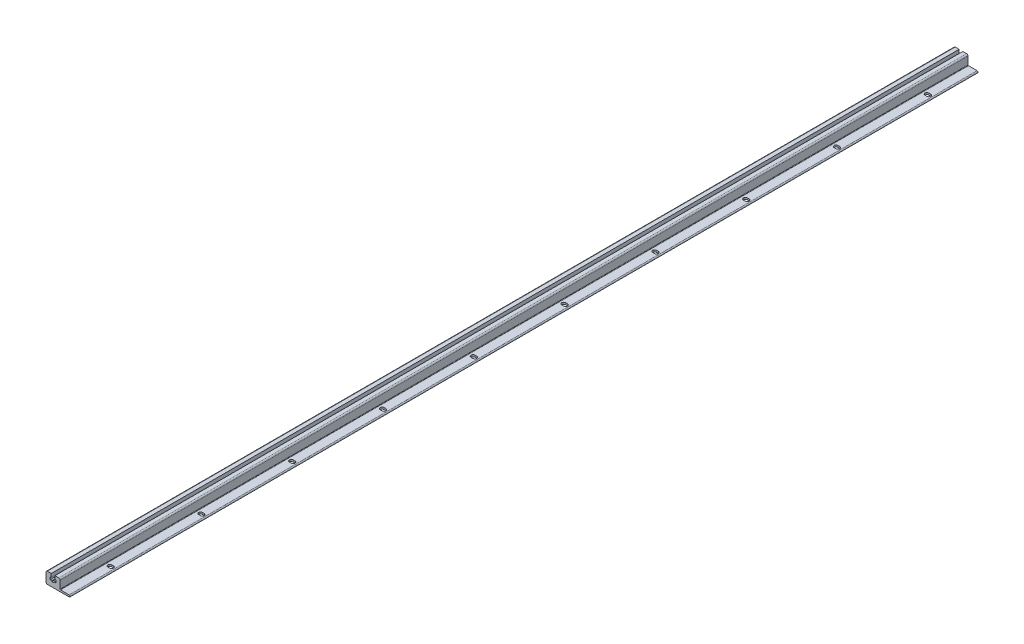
ISO-10303-21;
HEADER;
FILE_DESCRIPTION(('STEP AP214'),'2;1');
FILE_NAME('part.step','',(''),(''),'','','');
FILE_SCHEMA(('AUTOMOTIVE_DESIGN { 1 0 10303 214 1 1 1 1 }'));
ENDSEC;
DATA;
#1=APPLICATION_CONTEXT('core data for automotive mechanical design processes');
#2=APPLICATION_PROTOCOL_DEFINITION('international standard','automotive_design',2000,#1);
#3=PRODUCT_CONTEXT('',#1,'mechanical');
#4=PRODUCT('Part','Part','',(#3));
#5=PRODUCT_RELATED_PRODUCT_CATEGORY('part','',(#4));
#6=PRODUCT_DEFINITION_FORMATION('','',#4);
#7=PRODUCT_DEFINITION_CONTEXT('part definition',#1,'design');
#8=PRODUCT_DEFINITION('design','',#6,#7);
#9=PRODUCT_DEFINITION_SHAPE('','',#8);
#10=(LENGTH_UNIT() NAMED_UNIT(*) SI_UNIT(.MILLI.,.METRE.));
#11=(NAMED_UNIT(*) PLANE_ANGLE_UNIT() SI_UNIT($,.RADIAN.));
#12=(NAMED_UNIT(*) SI_UNIT($,.STERADIAN.) SOLID_ANGLE_UNIT());
#13=UNCERTAINTY_MEASURE_WITH_UNIT(LENGTH_MEASURE(1.E-05),#10,'distance_accuracy_value','');
#14=(GEOMETRIC_REPRESENTATION_CONTEXT(3) GLOBAL_UNCERTAINTY_ASSIGNED_CONTEXT((#13)) GLOBAL_UNIT_ASSIGNED_CONTEXT((#10,
#11,#12)) REPRESENTATION_CONTEXT('',''));
#15=CARTESIAN_POINT('',(0.,0.,0.));
#16=DIRECTION('',(0.,0.,1.));
#17=DIRECTION('',(1.,0.,0.));
#18=AXIS2_PLACEMENT_3D('',#15,#16,#17);
#19=CARTESIAN_POINT('',(-6.20000381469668,12.2000000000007,0.));
#20=DIRECTION('',(0.,1.,0.));
#21=DIRECTION('',(0.,0.,1.));
#22=AXIS2_PLACEMENT_3D('',#19,#20,#21);
#23=PLANE('',#22);
#24=DIRECTION('',(0.,0.,1.));
#25=VECTOR('',#24,1.);
#26=CARTESIAN_POINT('',(-2.55,12.2000000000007,0.));
#27=LINE('',#26,#25);
#28=CARTESIAN_POINT('',(-2.55,12.2000000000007,0.));
#29=VERTEX_POINT('',#28);
#30=CARTESIAN_POINT('',(-2.55,12.2000000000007,2000.));
#31=VERTEX_POINT('',#30);
#32=EDGE_CURVE('E432',#29,#31,#27,.T.);
#33=ORIENTED_EDGE('',*,*,#32,.F.);
#34=DIRECTION('',(-1.,0.,0.));
#35=VECTOR('',#34,1.);
#36=CARTESIAN_POINT('',(-6.20000381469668,12.2000000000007,0.));
#37=LINE('',#36,#35);
#38=CARTESIAN_POINT('',(-6.20000381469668,12.2000000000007,0.));
#39=VERTEX_POINT('',#38);
#40=EDGE_CURVE('E423',#29,#39,#37,.T.);
#41=ORIENTED_EDGE('',*,*,#40,.T.);
#42=DIRECTION('',(0.,0.,1.));
#43=VECTOR('',#42,1.);
#44=CARTESIAN_POINT('',(-6.20000381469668,12.2000000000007,0.));
#45=LINE('',#44,#43);
#46=CARTESIAN_POINT('',(-6.20000381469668,12.2000000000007,2000.));
#47=VERTEX_POINT('',#46);
#48=EDGE_CURVE('E878',#39,#47,#45,.T.);
#49=ORIENTED_EDGE('',*,*,#48,.T.);
#50=DIRECTION('',(-1.,0.,0.));
#51=VECTOR('',#50,1.);
#52=CARTESIAN_POINT('',(-6.20000381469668,12.2000000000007,2000.));
#53=LINE('',#52,#51);
#54=EDGE_CURVE('E783',#31,#47,#53,.T.);
#55=ORIENTED_EDGE('',*,*,#54,.F.);
#56=EDGE_LOOP('',(#33,#41,#49,#55));
#57=FACE_BOUND('',#56,.T.);
#58=ADVANCED_FACE('F14',(#57),#23,.T.);
#59=CARTESIAN_POINT('',(35.5,2.,0.));
#60=DIRECTION('',(0.,0.,1.));
#61=DIRECTION('',(1.,0.,0.));
#62=AXIS2_PLACEMENT_3D('',#59,#60,#61);
#63=CYLINDRICAL_SURFACE('',#62,2.);
#64=CARTESIAN_POINT('',(35.5,2.,2000.));
#65=DIRECTION('',(0.,0.,1.));
#66=DIRECTION('',(1.,0.,0.));
#67=AXIS2_PLACEMENT_3D('',#64,#65,#66);
#68=CIRCLE('',#67,2.);
#69=CARTESIAN_POINT('',(35.5,0.,2000.));
#70=VERTEX_POINT('',#69);
#71=CARTESIAN_POINT('',(35.4999999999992,4.,2000.));
#72=VERTEX_POINT('',#71);
#73=EDGE_CURVE('E750',#70,#72,#68,.T.);
#74=ORIENTED_EDGE('',*,*,#73,.F.);
#75=DIRECTION('',(0.,0.,1.));
#76=VECTOR('',#75,1.);
#77=CARTESIAN_POINT('',(35.5,0.,0.));
#78=LINE('',#77,#76);
#79=CARTESIAN_POINT('',(35.5,0.,0.));
#80=VERTEX_POINT('',#79);
#81=EDGE_CURVE('E9',#80,#70,#78,.T.);
#82=ORIENTED_EDGE('',*,*,#81,.F.);
#83=CARTESIAN_POINT('',(35.5,2.,0.));
#84=DIRECTION('',(0.,0.,1.));
#85=DIRECTION('',(1.,0.,0.));
#86=AXIS2_PLACEMENT_3D('',#83,#84,#85);
#87=CIRCLE('',#86,2.);
#88=CARTESIAN_POINT('',(35.4999999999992,4.,0.));
#89=VERTEX_POINT('',#88);
#90=EDGE_CURVE('E811',#80,#89,#87,.T.);
#91=ORIENTED_EDGE('',*,*,#90,.T.);
#92=DIRECTION('',(0.,0.,1.));
#93=VECTOR('',#92,1.);
#94=CARTESIAN_POINT('',(35.4999999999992,4.,0.));
#95=LINE('',#94,#93);
#96=EDGE_CURVE('E18',#89,#72,#95,.T.);
#97=ORIENTED_EDGE('',*,*,#96,.T.);
#98=EDGE_LOOP('',(#74,#82,#91,#97));
#99=FACE_BOUND('',#98,.T.);
#100=ADVANCED_FACE('F16',(#99),#63,.T.);
#101=CARTESIAN_POINT('',(-12.5,0.,0.));
#102=DIRECTION('',(0.,-1.,0.));
#103=DIRECTION('',(0.,0.,-1.));
#104=AXIS2_PLACEMENT_3D('',#101,#102,#103);
#105=PLANE('',#104);
#106=CARTESIAN_POINT('',(24.9999999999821,0.,100.));
#107=DIRECTION('',(0.,1.,0.));
#108=DIRECTION('',(0.,0.,1.));
#109=AXIS2_PLACEMENT_3D('',#106,#107,#108);
#110=CIRCLE('',#109,4.25);
#111=CARTESIAN_POINT('',(24.9999999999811,0.,95.75));
#112=VERTEX_POINT('',#111);
#113=CARTESIAN_POINT('',(24.9999999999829,0.,104.25));
#114=VERTEX_POINT('',#113);
#115=EDGE_CURVE('E449',#112,#114,#110,.T.);
#116=ORIENTED_EDGE('',*,*,#115,.T.);
#117=DIRECTION('',(1.,0.,0.));
#118=VECTOR('',#117,1.);
#119=CARTESIAN_POINT('',(28.9999999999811,0.,104.25));
#120=LINE('',#119,#118);
#121=CARTESIAN_POINT('',(28.9999999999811,0.,104.25));
#122=VERTEX_POINT('',#121);
#123=EDGE_CURVE('E452',#114,#122,#120,.T.);
#124=ORIENTED_EDGE('',*,*,#123,.T.);
#125=CARTESIAN_POINT('',(28.9999999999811,0.,100.));
#126=DIRECTION('',(0.,1.,0.));
#127=DIRECTION('',(0.,0.,1.));
#128=AXIS2_PLACEMENT_3D('',#125,#126,#127);
#129=CIRCLE('',#128,4.25);
#130=CARTESIAN_POINT('',(28.9999999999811,0.,95.75));
#131=VERTEX_POINT('',#130);
#132=EDGE_CURVE('E39',#122,#131,#129,.T.);
#133=ORIENTED_EDGE('',*,*,#132,.T.);
#134=DIRECTION('',(-1.,0.,0.));
#135=VECTOR('',#134,1.);
#136=CARTESIAN_POINT('',(28.9999999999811,0.,95.75));
#137=LINE('',#136,#135);
#138=EDGE_CURVE('E456',#131,#112,#137,.T.);
#139=ORIENTED_EDGE('',*,*,#138,.T.);
#140=EDGE_LOOP('',(#116,#124,#133,#139));
#141=FACE_BOUND('',#140,.T.);
#142=CARTESIAN_POINT('',(24.9999999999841,0.,300.));
#143=DIRECTION('',(0.,1.,0.));
#144=DIRECTION('',(0.,0.,1.));
#145=AXIS2_PLACEMENT_3D('',#142,#143,#144);
#146=CIRCLE('',#145,4.25);
#147=CARTESIAN_POINT('',(24.9999999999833,0.,295.75));
#148=VERTEX_POINT('',#147);
#149=CARTESIAN_POINT('',(24.999999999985,0.,304.25));
#150=VERTEX_POINT('',#149);
#151=EDGE_CURVE('E479',#148,#150,#146,.T.);
#152=ORIENTED_EDGE('',*,*,#151,.T.);
#153=DIRECTION('',(1.,0.,0.));
#154=VECTOR('',#153,1.);
#155=CARTESIAN_POINT('',(28.9999999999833,0.,304.25));
#156=LINE('',#155,#154);
#157=CARTESIAN_POINT('',(28.9999999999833,0.,304.25));
#158=VERTEX_POINT('',#157);
#159=EDGE_CURVE('E482',#150,#158,#156,.T.);
#160=ORIENTED_EDGE('',*,*,#159,.T.);
#161=CARTESIAN_POINT('',(28.9999999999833,0.,300.));
#162=DIRECTION('',(0.,1.,0.));
#163=DIRECTION('',(0.,0.,1.));
#164=AXIS2_PLACEMENT_3D('',#161,#162,#163);
#165=CIRCLE('',#164,4.25);
#166=CARTESIAN_POINT('',(28.9999999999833,0.,295.75));
#167=VERTEX_POINT('',#166);
#168=EDGE_CURVE('E485',#158,#167,#165,.T.);
#169=ORIENTED_EDGE('',*,*,#168,.T.);
#170=DIRECTION('',(-1.,0.,0.));
#171=VECTOR('',#170,1.);
#172=CARTESIAN_POINT('',(28.9999999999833,0.,295.75));
#173=LINE('',#172,#171);
#174=EDGE_CURVE('E488',#167,#148,#173,.T.);
#175=ORIENTED_EDGE('',*,*,#174,.T.);
#176=EDGE_LOOP('',(#152,#160,#169,#175));
#177=FACE_BOUND('',#176,.T.);
#178=CARTESIAN_POINT('',(24.9999999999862,0.,500.));
#179=DIRECTION('',(0.,1.,0.));
#180=DIRECTION('',(0.,0.,1.));
#181=AXIS2_PLACEMENT_3D('',#178,#179,#180);
#182=CIRCLE('',#181,4.25);
#183=CARTESIAN_POINT('',(24.9999999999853,0.,495.75));
#184=VERTEX_POINT('',#183);
#185=CARTESIAN_POINT('',(24.9999999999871,0.,504.25));
#186=VERTEX_POINT('',#185);
#187=EDGE_CURVE('E511',#184,#186,#182,.T.);
#188=ORIENTED_EDGE('',*,*,#187,.T.);
#189=DIRECTION('',(1.,0.,0.));
#190=VECTOR('',#189,1.);
#191=CARTESIAN_POINT('',(28.9999999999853,0.,504.25));
#192=LINE('',#191,#190);
#193=CARTESIAN_POINT('',(28.9999999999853,0.,504.25));
#194=VERTEX_POINT('',#193);
#195=EDGE_CURVE('E514',#186,#194,#192,.T.);
#196=ORIENTED_EDGE('',*,*,#195,.T.);
#197=CARTESIAN_POINT('',(28.9999999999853,0.,500.));
#198=DIRECTION('',(0.,1.,0.));
#199=DIRECTION('',(0.,0.,1.));
#200=AXIS2_PLACEMENT_3D('',#197,#198,#199);
#201=CIRCLE('',#200,4.25);
#202=CARTESIAN_POINT('',(28.9999999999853,0.,495.75));
#203=VERTEX_POINT('',#202);
#204=EDGE_CURVE('E517',#194,#203,#201,.T.);
#205=ORIENTED_EDGE('',*,*,#204,.T.);
#206=DIRECTION('',(-1.,0.,0.));
#207=VECTOR('',#206,1.);
#208=CARTESIAN_POINT('',(28.9999999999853,0.,495.75));
#209=LINE('',#208,#207);
#210=EDGE_CURVE('E520',#203,#184,#209,.T.);
#211=ORIENTED_EDGE('',*,*,#210,.T.);
#212=EDGE_LOOP('',(#188,#196,#205,#211));
#213=FACE_BOUND('',#212,.T.);
#214=CARTESIAN_POINT('',(24.9999999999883,0.,700.));
#215=DIRECTION('',(0.,1.,0.));
#216=DIRECTION('',(0.,0.,1.));
#217=AXIS2_PLACEMENT_3D('',#214,#215,#216);
#218=CIRCLE('',#217,4.25);
#219=CARTESIAN_POINT('',(24.9999999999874,0.,695.75));
#220=VERTEX_POINT('',#219);
#221=CARTESIAN_POINT('',(24.9999999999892,0.,704.25));
#222=VERTEX_POINT('',#221);
#223=EDGE_CURVE('E543',#220,#222,#218,.T.);
#224=ORIENTED_EDGE('',*,*,#223,.T.);
#225=DIRECTION('',(1.,0.,0.));
#226=VECTOR('',#225,1.);
#227=CARTESIAN_POINT('',(28.9999999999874,0.,704.25));
#228=LINE('',#227,#226);
#229=CARTESIAN_POINT('',(28.9999999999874,0.,704.25));
#230=VERTEX_POINT('',#229);
#231=EDGE_CURVE('E546',#222,#230,#228,.T.);
#232=ORIENTED_EDGE('',*,*,#231,.T.);
#233=CARTESIAN_POINT('',(28.9999999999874,0.,700.));
#234=DIRECTION('',(0.,1.,0.));
#235=DIRECTION('',(0.,0.,1.));
#236=AXIS2_PLACEMENT_3D('',#233,#234,#235);
#237=CIRCLE('',#236,4.25);
#238=CARTESIAN_POINT('',(28.9999999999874,0.,695.75));
#239=VERTEX_POINT('',#238);
#240=EDGE_CURVE('E549',#230,#239,#237,.T.);
#241=ORIENTED_EDGE('',*,*,#240,.T.);
#242=DIRECTION('',(-1.,0.,0.));
#243=VECTOR('',#242,1.);
#244=CARTESIAN_POINT('',(28.9999999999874,0.,695.75));
#245=LINE('',#244,#243);
#246=EDGE_CURVE('E552',#239,#220,#245,.T.);
#247=ORIENTED_EDGE('',*,*,#246,.T.);
#248=EDGE_LOOP('',(#224,#232,#241,#247));
#249=FACE_BOUND('',#248,.T.);
#250=CARTESIAN_POINT('',(24.9999999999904,0.,900.));
#251=DIRECTION('',(0.,1.,0.));
#252=DIRECTION('',(0.,0.,1.));
#253=AXIS2_PLACEMENT_3D('',#250,#251,#252);
#254=CIRCLE('',#253,4.25);
#255=CARTESIAN_POINT('',(24.9999999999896,0.,895.75));
#256=VERTEX_POINT('',#255);
#257=CARTESIAN_POINT('',(24.9999999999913,0.,904.25));
#258=VERTEX_POINT('',#257);
#259=EDGE_CURVE('E575',#256,#258,#254,.T.);
#260=ORIENTED_EDGE('',*,*,#259,.T.);
#261=DIRECTION('',(1.,0.,0.));
#262=VECTOR('',#261,1.);
#263=CARTESIAN_POINT('',(28.9999999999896,0.,904.25));
#264=LINE('',#263,#262);
#265=CARTESIAN_POINT('',(28.9999999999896,0.,904.25));
#266=VERTEX_POINT('',#265);
#267=EDGE_CURVE('E578',#258,#266,#264,.T.);
#268=ORIENTED_EDGE('',*,*,#267,.T.);
#269=CARTESIAN_POINT('',(28.9999999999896,0.,900.));
#270=DIRECTION('',(0.,1.,0.));
#271=DIRECTION('',(0.,0.,1.));
#272=AXIS2_PLACEMENT_3D('',#269,#270,#271);
#273=CIRCLE('',#272,4.25);
#274=CARTESIAN_POINT('',(28.9999999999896,0.,895.75));
#275=VERTEX_POINT('',#274);
#276=EDGE_CURVE('E581',#266,#275,#273,.T.);
#277=ORIENTED_EDGE('',*,*,#276,.T.);
#278=DIRECTION('',(-1.,0.,0.));
#279=VECTOR('',#278,1.);
#280=CARTESIAN_POINT('',(28.9999999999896,0.,895.75));
#281=LINE('',#280,#279);
#282=EDGE_CURVE('E584',#275,#256,#281,.T.);
#283=ORIENTED_EDGE('',*,*,#282,.T.);
#284=EDGE_LOOP('',(#260,#268,#277,#283));
#285=FACE_BOUND('',#284,.T.);
#286=CARTESIAN_POINT('',(24.9999999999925,0.,1100.));
#287=DIRECTION('',(0.,1.,0.));
#288=DIRECTION('',(0.,0.,1.));
#289=AXIS2_PLACEMENT_3D('',#286,#287,#288);
#290=CIRCLE('',#289,4.25);
#291=CARTESIAN_POINT('',(24.9999999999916,0.,1095.75));
#292=VERTEX_POINT('',#291);
#293=CARTESIAN_POINT('',(24.9999999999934,0.,1104.25));
#294=VERTEX_POINT('',#293);
#295=EDGE_CURVE('E607',#292,#294,#290,.T.);
#296=ORIENTED_EDGE('',*,*,#295,.T.);
#297=DIRECTION('',(1.,0.,0.));
#298=VECTOR('',#297,1.);
#299=CARTESIAN_POINT('',(28.9999999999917,0.,1104.25));
#300=LINE('',#299,#298);
#301=CARTESIAN_POINT('',(28.9999999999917,0.,1104.25));
#302=VERTEX_POINT('',#301);
#303=EDGE_CURVE('E610',#294,#302,#300,.T.);
#304=ORIENTED_EDGE('',*,*,#303,.T.);
#305=CARTESIAN_POINT('',(28.9999999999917,0.,1100.));
#306=DIRECTION('',(0.,1.,0.));
#307=DIRECTION('',(0.,0.,1.));
#308=AXIS2_PLACEMENT_3D('',#305,#306,#307);
#309=CIRCLE('',#308,4.25);
#310=CARTESIAN_POINT('',(28.9999999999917,0.,1095.75));
#311=VERTEX_POINT('',#310);
#312=EDGE_CURVE('E613',#302,#311,#309,.T.);
#313=ORIENTED_EDGE('',*,*,#312,.T.);
#314=DIRECTION('',(-1.,0.,0.));
#315=VECTOR('',#314,1.);
#316=CARTESIAN_POINT('',(28.9999999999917,0.,1095.75));
#317=LINE('',#316,#315);
#318=EDGE_CURVE('E616',#311,#292,#317,.T.);
#319=ORIENTED_EDGE('',*,*,#318,.T.);
#320=EDGE_LOOP('',(#296,#304,#313,#319));
#321=FACE_BOUND('',#320,.T.);
#322=CARTESIAN_POINT('',(24.9999999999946,0.,1300.));
#323=DIRECTION('',(0.,1.,0.));
#324=DIRECTION('',(0.,0.,1.));
#325=AXIS2_PLACEMENT_3D('',#322,#323,#324);
#326=CIRCLE('',#325,4.25);
#327=CARTESIAN_POINT('',(24.9999999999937,0.,1295.75));
#328=VERTEX_POINT('',#327);
#329=CARTESIAN_POINT('',(24.9999999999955,0.,1304.25));
#330=VERTEX_POINT('',#329);
#331=EDGE_CURVE('E639',#328,#330,#326,.T.);
#332=ORIENTED_EDGE('',*,*,#331,.T.);
#333=DIRECTION('',(1.,0.,0.));
#334=VECTOR('',#333,1.);
#335=CARTESIAN_POINT('',(28.9999999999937,0.,1304.25));
#336=LINE('',#335,#334);
#337=CARTESIAN_POINT('',(28.9999999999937,0.,1304.25));
#338=VERTEX_POINT('',#337);
#339=EDGE_CURVE('E642',#330,#338,#336,.T.);
#340=ORIENTED_EDGE('',*,*,#339,.T.);
#341=CARTESIAN_POINT('',(28.9999999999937,0.,1300.));
#342=DIRECTION('',(0.,1.,0.));
#343=DIRECTION('',(0.,0.,1.));
#344=AXIS2_PLACEMENT_3D('',#341,#342,#343);
#345=CIRCLE('',#344,4.25);
#346=CARTESIAN_POINT('',(28.9999999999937,0.,1295.75));
#347=VERTEX_POINT('',#346);
#348=EDGE_CURVE('E645',#338,#347,#345,.T.);
#349=ORIENTED_EDGE('',*,*,#348,.T.);
#350=DIRECTION('',(-1.,0.,0.));
#351=VECTOR('',#350,1.);
#352=CARTESIAN_POINT('',(28.9999999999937,0.,1295.75));
#353=LINE('',#352,#351);
#354=EDGE_CURVE('E648',#347,#328,#353,.T.);
#355=ORIENTED_EDGE('',*,*,#354,.T.);
#356=EDGE_LOOP('',(#332,#340,#349,#355));
#357=FACE_BOUND('',#356,.T.);
#358=CARTESIAN_POINT('',(24.9999999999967,0.,1500.));
#359=DIRECTION('',(0.,1.,0.));
#360=DIRECTION('',(0.,0.,1.));
#361=AXIS2_PLACEMENT_3D('',#358,#359,#360);
#362=CIRCLE('',#361,4.25);
#363=CARTESIAN_POINT('',(24.9999999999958,0.,1495.75));
#364=VERTEX_POINT('',#363);
#365=CARTESIAN_POINT('',(24.9999999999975,0.,1504.25));
#366=VERTEX_POINT('',#365);
#367=EDGE_CURVE('E671',#364,#366,#362,.T.);
#368=ORIENTED_EDGE('',*,*,#367,.T.);
#369=DIRECTION('',(1.,0.,0.));
#370=VECTOR('',#369,1.);
#371=CARTESIAN_POINT('',(28.9999999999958,0.,1504.25));
#372=LINE('',#371,#370);
#373=CARTESIAN_POINT('',(28.9999999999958,0.,1504.25));
#374=VERTEX_POINT('',#373);
#375=EDGE_CURVE('E674',#366,#374,#372,.T.);
#376=ORIENTED_EDGE('',*,*,#375,.T.);
#377=CARTESIAN_POINT('',(28.9999999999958,0.,1500.));
#378=DIRECTION('',(0.,1.,0.));
#379=DIRECTION('',(0.,0.,1.));
#380=AXIS2_PLACEMENT_3D('',#377,#378,#379);
#381=CIRCLE('',#380,4.25);
#382=CARTESIAN_POINT('',(28.9999999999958,0.,1495.75));
#383=VERTEX_POINT('',#382);
#384=EDGE_CURVE('E677',#374,#383,#381,.T.);
#385=ORIENTED_EDGE('',*,*,#384,.T.);
#386=DIRECTION('',(-1.,0.,0.));
#387=VECTOR('',#386,1.);
#388=CARTESIAN_POINT('',(28.9999999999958,0.,1495.75));
#389=LINE('',#388,#387);
#390=EDGE_CURVE('E680',#383,#364,#389,.T.);
#391=ORIENTED_EDGE('',*,*,#390,.T.);
#392=EDGE_LOOP('',(#368,#376,#385,#391));
#393=FACE_BOUND('',#392,.T.);
#394=CARTESIAN_POINT('',(25.0000000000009,0.,1900.));
#395=DIRECTION('',(0.,1.,0.));
#396=DIRECTION('',(0.,0.,1.));
#397=AXIS2_PLACEMENT_3D('',#394,#395,#396);
#398=CIRCLE('',#397,4.25);
#399=CARTESIAN_POINT('',(25.,0.,1895.75));
#400=VERTEX_POINT('',#399);
#401=CARTESIAN_POINT('',(25.0000000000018,0.,1904.25));
#402=VERTEX_POINT('',#401);
#403=EDGE_CURVE('E703',#400,#402,#398,.T.);
#404=ORIENTED_EDGE('',*,*,#403,.T.);
#405=DIRECTION('',(1.,0.,0.));
#406=VECTOR('',#405,1.);
#407=CARTESIAN_POINT('',(29.,0.,1904.25));
#408=LINE('',#407,#406);
#409=CARTESIAN_POINT('',(29.,0.,1904.25));
#410=VERTEX_POINT('',#409);
#411=EDGE_CURVE('E706',#402,#410,#408,.T.);
#412=ORIENTED_EDGE('',*,*,#411,.T.);
#413=CARTESIAN_POINT('',(29.,0.,1900.));
#414=DIRECTION('',(0.,1.,0.));
#415=DIRECTION('',(0.,0.,1.));
#416=AXIS2_PLACEMENT_3D('',#413,#414,#415);
#417=CIRCLE('',#416,4.25);
#418=CARTESIAN_POINT('',(29.,0.,1895.75));
#419=VERTEX_POINT('',#418);
#420=EDGE_CURVE('E709',#410,#419,#417,.T.);
#421=ORIENTED_EDGE('',*,*,#420,.T.);
#422=DIRECTION('',(-1.,0.,0.));
#423=VECTOR('',#422,1.);
#424=CARTESIAN_POINT('',(29.,0.,1895.75));
#425=LINE('',#424,#423);
#426=EDGE_CURVE('E712',#419,#400,#425,.T.);
#427=ORIENTED_EDGE('',*,*,#426,.T.);
#428=EDGE_LOOP('',(#404,#412,#421,#427));
#429=FACE_BOUND('',#428,.T.);
#430=CARTESIAN_POINT('',(24.9999999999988,0.,1700.));
#431=DIRECTION('',(0.,1.,0.));
#432=DIRECTION('',(0.,0.,1.));
#433=AXIS2_PLACEMENT_3D('',#430,#431,#432);
#434=CIRCLE('',#433,4.25);
#435=CARTESIAN_POINT('',(24.9999999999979,0.,1695.75));
#436=VERTEX_POINT('',#435);
#437=CARTESIAN_POINT('',(24.9999999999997,0.,1704.25));
#438=VERTEX_POINT('',#437);
#439=EDGE_CURVE('E735',#436,#438,#434,.T.);
#440=ORIENTED_EDGE('',*,*,#439,.T.);
#441=DIRECTION('',(1.,0.,0.));
#442=VECTOR('',#441,1.);
#443=CARTESIAN_POINT('',(28.9999999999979,0.,1704.25));
#444=LINE('',#443,#442);
#445=CARTESIAN_POINT('',(28.9999999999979,0.,1704.25));
#446=VERTEX_POINT('',#445);
#447=EDGE_CURVE('E738',#438,#446,#444,.T.);
#448=ORIENTED_EDGE('',*,*,#447,.T.);
#449=CARTESIAN_POINT('',(28.9999999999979,0.,1700.));
#450=DIRECTION('',(0.,1.,0.));
#451=DIRECTION('',(0.,0.,1.));
#452=AXIS2_PLACEMENT_3D('',#449,#450,#451);
#453=CIRCLE('',#452,4.25);
#454=CARTESIAN_POINT('',(28.9999999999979,0.,1695.75));
#455=VERTEX_POINT('',#454);
#456=EDGE_CURVE('E741',#446,#455,#453,.T.);
#457=ORIENTED_EDGE('',*,*,#456,.T.);
#458=DIRECTION('',(-1.,0.,0.));
#459=VECTOR('',#458,1.);
#460=CARTESIAN_POINT('',(28.9999999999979,0.,1695.75));
#461=LINE('',#460,#459);
#462=EDGE_CURVE('E744',#455,#436,#461,.T.);
#463=ORIENTED_EDGE('',*,*,#462,.T.);
#464=EDGE_LOOP('',(#440,#448,#457,#463));
#465=FACE_BOUND('',#464,.T.);
#466=DIRECTION('',(1.,0.,0.));
#467=VECTOR('',#466,1.);
#468=CARTESIAN_POINT('',(-12.5,0.,2000.));
#469=LINE('',#468,#467);
#470=CARTESIAN_POINT('',(-12.5,0.,2000.));
#471=VERTEX_POINT('',#470);
#472=EDGE_CURVE('E808',#471,#70,#469,.T.);
#473=ORIENTED_EDGE('',*,*,#472,.F.);
#474=DIRECTION('',(0.,0.,1.));
#475=VECTOR('',#474,1.);
#476=CARTESIAN_POINT('',(-12.5,0.,0.));
#477=LINE('',#476,#475);
#478=CARTESIAN_POINT('',(-12.5,0.,0.));
#479=VERTEX_POINT('',#478);
#480=EDGE_CURVE('E23',#479,#471,#477,.T.);
#481=ORIENTED_EDGE('',*,*,#480,.F.);
#482=DIRECTION('',(1.,0.,0.));
#483=VECTOR('',#482,1.);
#484=CARTESIAN_POINT('',(-12.5,0.,0.));
#485=LINE('',#484,#483);
#486=EDGE_CURVE('E862',#479,#80,#485,.T.);
#487=ORIENTED_EDGE('',*,*,#486,.T.);
#488=ORIENTED_EDGE('',*,*,#81,.T.);
#489=EDGE_LOOP('',(#473,#481,#487,#488));
#490=FACE_BOUND('',#489,.T.);
#491=ADVANCED_FACE('F908',(#141,#177,#213,#249,#285,#321,#357,#393,#429,#465,#490),#105,.T.);
#492=CARTESIAN_POINT('',(-12.5,3.,0.));
#493=DIRECTION('',(0.,0.,1.));
#494=DIRECTION('',(1.,0.,0.));
#495=AXIS2_PLACEMENT_3D('',#492,#493,#494);
#496=CYLINDRICAL_SURFACE('',#495,3.);
#497=CARTESIAN_POINT('',(-12.5,3.,2000.));
#498=DIRECTION('',(0.,0.,1.));
#499=DIRECTION('',(-1.,0.,0.));
#500=AXIS2_PLACEMENT_3D('',#497,#498,#499);
#501=CIRCLE('',#500,3.);
#502=CARTESIAN_POINT('',(-15.5,3.,2000.));
#503=VERTEX_POINT('',#502);
#504=EDGE_CURVE('E805',#503,#471,#501,.T.);
#505=ORIENTED_EDGE('',*,*,#504,.F.);
#506=DIRECTION('',(0.,0.,1.));
#507=VECTOR('',#506,1.);
#508=CARTESIAN_POINT('',(-15.5,3.,0.));
#509=LINE('',#508,#507);
#510=CARTESIAN_POINT('',(-15.5,3.,0.));
#511=VERTEX_POINT('',#510);
#512=EDGE_CURVE('E866',#511,#503,#509,.T.);
#513=ORIENTED_EDGE('',*,*,#512,.F.);
#514=CARTESIAN_POINT('',(-12.5,3.,0.));
#515=DIRECTION('',(0.,0.,1.));
#516=DIRECTION('',(-1.,0.,0.));
#517=AXIS2_PLACEMENT_3D('',#514,#515,#516);
#518=CIRCLE('',#517,3.);
#519=EDGE_CURVE('E859',#511,#479,#518,.T.);
#520=ORIENTED_EDGE('',*,*,#519,.T.);
#521=ORIENTED_EDGE('',*,*,#480,.T.);
#522=EDGE_LOOP('',(#505,#513,#520,#521));
#523=FACE_BOUND('',#522,.T.);
#524=ADVANCED_FACE('F972',(#523),#496,.T.);
#525=CARTESIAN_POINT('',(-15.5,22.,0.));
#526=DIRECTION('',(-1.,0.,0.));
#527=DIRECTION('',(0.,0.,1.));
#528=AXIS2_PLACEMENT_3D('',#525,#526,#527);
#529=PLANE('',#528);
#530=DIRECTION('',(0.,-1.,0.));
#531=VECTOR('',#530,1.);
#532=CARTESIAN_POINT('',(-15.5,22.,2000.));
#533=LINE('',#532,#531);
#534=CARTESIAN_POINT('',(-15.5,22.,2000.));
#535=VERTEX_POINT('',#534);
#536=EDGE_CURVE('E802',#535,#503,#533,.T.);
#537=ORIENTED_EDGE('',*,*,#536,.F.);
#538=DIRECTION('',(0.,0.,1.));
#539=VECTOR('',#538,1.);
#540=CARTESIAN_POINT('',(-15.5,22.,0.));
#541=LINE('',#540,#539);
#542=CARTESIAN_POINT('',(-15.5,22.,0.));
#543=VERTEX_POINT('',#542);
#544=EDGE_CURVE('E868',#543,#535,#541,.T.);
#545=ORIENTED_EDGE('',*,*,#544,.F.);
#546=DIRECTION('',(0.,-1.,0.));
#547=VECTOR('',#546,1.);
#548=CARTESIAN_POINT('',(-15.5,22.,0.));
#549=LINE('',#548,#547);
#550=EDGE_CURVE('E856',#543,#511,#549,.T.);
#551=ORIENTED_EDGE('',*,*,#550,.T.);
#552=ORIENTED_EDGE('',*,*,#512,.T.);
#553=EDGE_LOOP('',(#537,#545,#551,#552));
#554=FACE_BOUND('',#553,.T.);
#555=ADVANCED_FACE('F970',(#554),#529,.T.);
#556=CARTESIAN_POINT('',(-12.5,22.0000000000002,0.));
#557=DIRECTION('',(0.,0.,1.));
#558=DIRECTION('',(1.,0.,0.));
#559=AXIS2_PLACEMENT_3D('',#556,#557,#558);
#560=CYLINDRICAL_SURFACE('',#559,3.);
#561=CARTESIAN_POINT('',(-12.5,22.0000000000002,2000.));
#562=DIRECTION('',(0.,0.,1.));
#563=DIRECTION('',(-1.,0.,0.));
#564=AXIS2_PLACEMENT_3D('',#561,#562,#563);
#565=CIRCLE('',#564,3.);
#566=CARTESIAN_POINT('',(-12.5,25.,2000.));
#567=VERTEX_POINT('',#566);
#568=EDGE_CURVE('E799',#567,#535,#565,.T.);
#569=ORIENTED_EDGE('',*,*,#568,.F.);
#570=DIRECTION('',(0.,0.,1.));
#571=VECTOR('',#570,1.);
#572=CARTESIAN_POINT('',(-12.5,25.,0.));
#573=LINE('',#572,#571);
#574=CARTESIAN_POINT('',(-12.5,25.,0.));
#575=VERTEX_POINT('',#574);
#576=EDGE_CURVE('E870',#575,#567,#573,.T.);
#577=ORIENTED_EDGE('',*,*,#576,.F.);
#578=CARTESIAN_POINT('',(-12.5,22.0000000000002,0.));
#579=DIRECTION('',(0.,0.,1.));
#580=DIRECTION('',(-1.,0.,0.));
#581=AXIS2_PLACEMENT_3D('',#578,#579,#580);
#582=CIRCLE('',#581,3.);
#583=EDGE_CURVE('E853',#575,#543,#582,.T.);
#584=ORIENTED_EDGE('',*,*,#583,.T.);
#585=ORIENTED_EDGE('',*,*,#544,.T.);
#586=EDGE_LOOP('',(#569,#577,#584,#585));
#587=FACE_BOUND('',#586,.T.);
#588=ADVANCED_FACE('F966',(#587),#560,.T.);
#589=CARTESIAN_POINT('',(-12.5,25.,0.));
#590=DIRECTION('',(0.,1.,0.));
#591=DIRECTION('',(0.,0.,1.));
#592=AXIS2_PLACEMENT_3D('',#589,#590,#591);
#593=PLANE('',#592);
#594=DIRECTION('',(-1.,0.,0.));
#595=VECTOR('',#594,1.);
#596=CARTESIAN_POINT('',(-12.5,25.,2000.));
#597=LINE('',#596,#595);
#598=CARTESIAN_POINT('',(-4.10000381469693,25.,2000.));
#599=VERTEX_POINT('',#598);
#600=EDGE_CURVE('E796',#599,#567,#597,.T.);
#601=ORIENTED_EDGE('',*,*,#600,.F.);
#602=DIRECTION('',(0.,0.,1.));
#603=VECTOR('',#602,1.);
#604=CARTESIAN_POINT('',(-4.10000381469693,25.,0.));
#605=LINE('',#604,#603);
#606=CARTESIAN_POINT('',(-4.10000381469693,25.,0.));
#607=VERTEX_POINT('',#606);
#608=EDGE_CURVE('E872',#607,#599,#605,.T.);
#609=ORIENTED_EDGE('',*,*,#608,.F.);
#610=DIRECTION('',(-1.,0.,0.));
#611=VECTOR('',#610,1.);
#612=CARTESIAN_POINT('',(-12.5,25.,0.));
#613=LINE('',#612,#611);
#614=EDGE_CURVE('E850',#607,#575,#613,.T.);
#615=ORIENTED_EDGE('',*,*,#614,.T.);
#616=ORIENTED_EDGE('',*,*,#576,.T.);
#617=EDGE_LOOP('',(#601,#609,#615,#616));
#618=FACE_BOUND('',#617,.T.);
#619=ADVANCED_FACE('F962',(#618),#593,.T.);
#620=CARTESIAN_POINT('',(-4.10000381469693,25.,0.));
#621=DIRECTION('',(1.,0.,0.));
#622=DIRECTION('',(0.,0.,-1.));
#623=AXIS2_PLACEMENT_3D('',#620,#621,#622);
#624=PLANE('',#623);
#625=DIRECTION('',(0.,1.,0.));
#626=VECTOR('',#625,1.);
#627=CARTESIAN_POINT('',(-4.10000381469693,25.,2000.));
#628=LINE('',#627,#626);
#629=CARTESIAN_POINT('',(-4.10000381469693,17.400000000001,2000.));
#630=VERTEX_POINT('',#629);
#631=EDGE_CURVE('E793',#630,#599,#628,.T.);
#632=ORIENTED_EDGE('',*,*,#631,.F.);
#633=DIRECTION('',(0.,0.,1.));
#634=VECTOR('',#633,1.);
#635=CARTESIAN_POINT('',(-4.10000381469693,17.400000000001,0.));
#636=LINE('',#635,#634);
#637=CARTESIAN_POINT('',(-4.10000381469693,17.400000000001,0.));
#638=VERTEX_POINT('',#637);
#639=EDGE_CURVE('E874',#638,#630,#636,.T.);
#640=ORIENTED_EDGE('',*,*,#639,.F.);
#641=DIRECTION('',(0.,1.,0.));
#642=VECTOR('',#641,1.);
#643=CARTESIAN_POINT('',(-4.10000381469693,25.,0.));
#644=LINE('',#643,#642);
#645=EDGE_CURVE('E847',#638,#607,#644,.T.);
#646=ORIENTED_EDGE('',*,*,#645,.T.);
#647=ORIENTED_EDGE('',*,*,#608,.T.);
#648=EDGE_LOOP('',(#632,#640,#646,#647));
#649=FACE_BOUND('',#648,.T.);
#650=ADVANCED_FACE('F958',(#649),#624,.T.);
#651=CARTESIAN_POINT('',(-4.10000381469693,17.400000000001,0.));
#652=DIRECTION('',(0.,-1.,0.));
#653=DIRECTION('',(0.,0.,-1.));
#654=AXIS2_PLACEMENT_3D('',#651,#652,#653);
#655=PLANE('',#654);
#656=DIRECTION('',(1.,0.,0.));
#657=VECTOR('',#656,1.);
#658=CARTESIAN_POINT('',(-4.10000381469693,17.400000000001,2000.));
#659=LINE('',#658,#657);
#660=CARTESIAN_POINT('',(-6.20000381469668,17.400000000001,2000.));
#661=VERTEX_POINT('',#660);
#662=EDGE_CURVE('E790',#661,#630,#659,.T.);
#663=ORIENTED_EDGE('',*,*,#662,.F.);
#664=DIRECTION('',(0.,0.,1.));
#665=VECTOR('',#664,1.);
#666=CARTESIAN_POINT('',(-6.20000381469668,17.400000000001,0.));
#667=LINE('',#666,#665);
#668=CARTESIAN_POINT('',(-6.20000381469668,17.400000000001,0.));
#669=VERTEX_POINT('',#668);
#670=EDGE_CURVE('E876',#669,#661,#667,.T.);
#671=ORIENTED_EDGE('',*,*,#670,.F.);
#672=DIRECTION('',(1.,0.,0.));
#673=VECTOR('',#672,1.);
#674=CARTESIAN_POINT('',(-4.10000381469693,17.400000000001,0.));
#675=LINE('',#674,#673);
#676=EDGE_CURVE('E844',#669,#638,#675,.T.);
#677=ORIENTED_EDGE('',*,*,#676,.T.);
#678=ORIENTED_EDGE('',*,*,#639,.T.);
#679=EDGE_LOOP('',(#663,#671,#677,#678));
#680=FACE_BOUND('',#679,.T.);
#681=ADVANCED_FACE('F954',(#680),#655,.T.);
#682=CARTESIAN_POINT('',(-6.20000381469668,17.400000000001,0.));
#683=DIRECTION('',(1.,0.,0.));
#684=DIRECTION('',(0.,0.,-1.));
#685=AXIS2_PLACEMENT_3D('',#682,#683,#684);
#686=PLANE('',#685);
#687=DIRECTION('',(0.,1.,0.));
#688=VECTOR('',#687,1.);
#689=CARTESIAN_POINT('',(-6.20000381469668,17.400000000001,2000.));
#690=LINE('',#689,#688);
#691=EDGE_CURVE('E787',#47,#661,#690,.T.);
#692=ORIENTED_EDGE('',*,*,#691,.F.);
#693=ORIENTED_EDGE('',*,*,#48,.F.);
#694=DIRECTION('',(0.,1.,0.));
#695=VECTOR('',#694,1.);
#696=CARTESIAN_POINT('',(-6.20000381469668,17.400000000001,0.));
#697=LINE('',#696,#695);
#698=EDGE_CURVE('E841',#39,#669,#697,.T.);
#699=ORIENTED_EDGE('',*,*,#698,.T.);
#700=ORIENTED_EDGE('',*,*,#670,.T.);
#701=EDGE_LOOP('',(#692,#693,#699,#700));
#702=FACE_BOUND('',#701,.T.);
#703=ADVANCED_FACE('F950',(#702),#686,.T.);
#704=DIRECTION('',(0.,0.,1.));
#705=VECTOR('',#704,1.);
#706=CARTESIAN_POINT('',(2.55,12.2000000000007,0.));
#707=LINE('',#706,#705);
#708=CARTESIAN_POINT('',(2.55,12.2000000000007,0.));
#709=VERTEX_POINT('',#708);
#710=CARTESIAN_POINT('',(2.55,12.2000000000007,2000.));
#711=VERTEX_POINT('',#710);
#712=EDGE_CURVE('E435',#709,#711,#707,.T.);
#713=ORIENTED_EDGE('',*,*,#712,.T.);
#714=CARTESIAN_POINT('',(6.20000381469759,12.2000000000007,2000.));
#715=VERTEX_POINT('',#714);
#716=EDGE_CURVE('E784',#715,#711,#53,.T.);
#717=ORIENTED_EDGE('',*,*,#716,.F.);
#718=DIRECTION('',(0.,0.,1.));
#719=VECTOR('',#718,1.);
#720=CARTESIAN_POINT('',(6.20000381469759,12.2000000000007,0.));
#721=LINE('',#720,#719);
#722=CARTESIAN_POINT('',(6.20000381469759,12.2000000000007,0.));
#723=VERTEX_POINT('',#722);
#724=EDGE_CURVE('E881',#723,#715,#721,.T.);
#725=ORIENTED_EDGE('',*,*,#724,.F.);
#726=EDGE_CURVE('E838',#723,#709,#37,.T.);
#727=ORIENTED_EDGE('',*,*,#726,.T.);
#728=EDGE_LOOP('',(#713,#717,#725,#727));
#729=FACE_BOUND('',#728,.T.);
#730=ADVANCED_FACE('F941',(#729),#23,.T.);
#731=CARTESIAN_POINT('',(6.20000381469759,17.400000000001,0.));
#732=DIRECTION('',(-1.,0.,0.));
#733=DIRECTION('',(0.,0.,1.));
#734=AXIS2_PLACEMENT_3D('',#731,#732,#733);
#735=PLANE('',#734);
#736=DIRECTION('',(0.,-1.,0.));
#737=VECTOR('',#736,1.);
#738=CARTESIAN_POINT('',(6.20000381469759,17.400000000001,2000.));
#739=LINE('',#738,#737);
#740=CARTESIAN_POINT('',(6.20000381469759,17.400000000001,2000.));
#741=VERTEX_POINT('',#740);
#742=EDGE_CURVE('E780',#741,#715,#739,.T.);
#743=ORIENTED_EDGE('',*,*,#742,.F.);
#744=DIRECTION('',(0.,0.,1.));
#745=VECTOR('',#744,1.);
#746=CARTESIAN_POINT('',(6.20000381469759,17.400000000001,0.));
#747=LINE('',#746,#745);
#748=CARTESIAN_POINT('',(6.20000381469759,17.400000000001,0.));
#749=VERTEX_POINT('',#748);
#750=EDGE_CURVE('E883',#749,#741,#747,.T.);
#751=ORIENTED_EDGE('',*,*,#750,.F.);
#752=DIRECTION('',(0.,-1.,0.));
#753=VECTOR('',#752,1.);
#754=CARTESIAN_POINT('',(6.20000381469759,17.400000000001,0.));
#755=LINE('',#754,#753);
#756=EDGE_CURVE('E835',#749,#723,#755,.T.);
#757=ORIENTED_EDGE('',*,*,#756,.T.);
#758=ORIENTED_EDGE('',*,*,#724,.T.);
#759=EDGE_LOOP('',(#743,#751,#757,#758));
#760=FACE_BOUND('',#759,.T.);
#761=ADVANCED_FACE('F937',(#760),#735,.T.);
#762=CARTESIAN_POINT('',(4.09999618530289,17.400000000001,0.));
#763=DIRECTION('',(0.,-1.,0.));
#764=DIRECTION('',(1.,0.,0.));
#765=AXIS2_PLACEMENT_3D('',#762,#763,#764);
#766=PLANE('',#765);
#767=DIRECTION('',(1.,0.,0.));
#768=VECTOR('',#767,1.);
#769=CARTESIAN_POINT('',(4.09999618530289,17.400000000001,2000.));
#770=LINE('',#769,#768);
#771=CARTESIAN_POINT('',(4.09999618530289,17.400000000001,2000.));
#772=VERTEX_POINT('',#771);
#773=EDGE_CURVE('E777',#772,#741,#770,.T.);
#774=ORIENTED_EDGE('',*,*,#773,.F.);
#775=DIRECTION('',(0.,0.,1.));
#776=VECTOR('',#775,1.);
#777=CARTESIAN_POINT('',(4.09999618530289,17.400000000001,0.));
#778=LINE('',#777,#776);
#779=CARTESIAN_POINT('',(4.09999618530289,17.400000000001,0.));
#780=VERTEX_POINT('',#779);
#781=EDGE_CURVE('E885',#780,#772,#778,.T.);
#782=ORIENTED_EDGE('',*,*,#781,.F.);
#783=DIRECTION('',(1.,0.,0.));
#784=VECTOR('',#783,1.);
#785=CARTESIAN_POINT('',(4.09999618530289,17.400000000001,0.));
#786=LINE('',#785,#784);
#787=EDGE_CURVE('E832',#780,#749,#786,.T.);
#788=ORIENTED_EDGE('',*,*,#787,.T.);
#789=ORIENTED_EDGE('',*,*,#750,.T.);
#790=EDGE_LOOP('',(#774,#782,#788,#789));
#791=FACE_BOUND('',#790,.T.);
#792=ADVANCED_FACE('F933',(#791),#766,.T.);
#793=CARTESIAN_POINT('',(4.09999618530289,25.,0.));
#794=DIRECTION('',(-1.,0.,0.));
#795=DIRECTION('',(0.,0.,1.));
#796=AXIS2_PLACEMENT_3D('',#793,#794,#795);
#797=PLANE('',#796);
#798=DIRECTION('',(0.,-1.,0.));
#799=VECTOR('',#798,1.);
#800=CARTESIAN_POINT('',(4.09999618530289,25.,2000.));
#801=LINE('',#800,#799);
#802=CARTESIAN_POINT('',(4.09999618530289,25.,2000.));
#803=VERTEX_POINT('',#802);
#804=EDGE_CURVE('E774',#803,#772,#801,.T.);
#805=ORIENTED_EDGE('',*,*,#804,.F.);
#806=DIRECTION('',(0.,0.,1.));
#807=VECTOR('',#806,1.);
#808=CARTESIAN_POINT('',(4.09999618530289,25.,0.));
#809=LINE('',#808,#807);
#810=CARTESIAN_POINT('',(4.09999618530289,25.,0.));
#811=VERTEX_POINT('',#810);
#812=EDGE_CURVE('E887',#811,#803,#809,.T.);
#813=ORIENTED_EDGE('',*,*,#812,.F.);
#814=DIRECTION('',(0.,-1.,0.));
#815=VECTOR('',#814,1.);
#816=CARTESIAN_POINT('',(4.09999618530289,25.,0.));
#817=LINE('',#816,#815);
#818=EDGE_CURVE('E829',#811,#780,#817,.T.);
#819=ORIENTED_EDGE('',*,*,#818,.T.);
#820=ORIENTED_EDGE('',*,*,#781,.T.);
#821=EDGE_LOOP('',(#805,#813,#819,#820));
#822=FACE_BOUND('',#821,.T.);
#823=ADVANCED_FACE('F929',(#822),#797,.T.);
#824=CARTESIAN_POINT('',(12.5,25.,0.));
#825=DIRECTION('',(0.,1.,0.));
#826=DIRECTION('',(0.,0.,1.));
#827=AXIS2_PLACEMENT_3D('',#824,#825,#826);
#828=PLANE('',#827);
#829=DIRECTION('',(-1.,0.,0.));
#830=VECTOR('',#829,1.);
#831=CARTESIAN_POINT('',(12.5,25.,2000.));
#832=LINE('',#831,#830);
#833=CARTESIAN_POINT('',(12.5,25.,2000.));
#834=VERTEX_POINT('',#833);
#835=EDGE_CURVE('E771',#834,#803,#832,.T.);
#836=ORIENTED_EDGE('',*,*,#835,.F.);
#837=DIRECTION('',(0.,0.,1.));
#838=VECTOR('',#837,1.);
#839=CARTESIAN_POINT('',(12.5,25.,0.));
#840=LINE('',#839,#838);
#841=CARTESIAN_POINT('',(12.5,25.,0.));
#842=VERTEX_POINT('',#841);
#843=EDGE_CURVE('E889',#842,#834,#840,.T.);
#844=ORIENTED_EDGE('',*,*,#843,.F.);
#845=DIRECTION('',(-1.,0.,0.));
#846=VECTOR('',#845,1.);
#847=CARTESIAN_POINT('',(12.5,25.,0.));
#848=LINE('',#847,#846);
#849=EDGE_CURVE('E826',#842,#811,#848,.T.);
#850=ORIENTED_EDGE('',*,*,#849,.T.);
#851=ORIENTED_EDGE('',*,*,#812,.T.);
#852=EDGE_LOOP('',(#836,#844,#850,#851));
#853=FACE_BOUND('',#852,.T.);
#854=ADVANCED_FACE('F925',(#853),#828,.T.);
#855=CARTESIAN_POINT('',(12.5,22.0000000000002,0.));
#856=DIRECTION('',(0.,0.,1.));
#857=DIRECTION('',(1.,0.,0.));
#858=AXIS2_PLACEMENT_3D('',#855,#856,#857);
#859=CYLINDRICAL_SURFACE('',#858,3.);
#860=CARTESIAN_POINT('',(12.5,22.0000000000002,2000.));
#861=DIRECTION('',(0.,0.,1.));
#862=DIRECTION('',(-1.,0.,0.));
#863=AXIS2_PLACEMENT_3D('',#860,#861,#862);
#864=CIRCLE('',#863,3.);
#865=CARTESIAN_POINT('',(15.5,22.,2000.));
#866=VERTEX_POINT('',#865);
#867=EDGE_CURVE('E768',#866,#834,#864,.T.);
#868=ORIENTED_EDGE('',*,*,#867,.F.);
#869=DIRECTION('',(0.,0.,1.));
#870=VECTOR('',#869,1.);
#871=CARTESIAN_POINT('',(15.5,22.,0.));
#872=LINE('',#871,#870);
#873=CARTESIAN_POINT('',(15.5,22.,0.));
#874=VERTEX_POINT('',#873);
#875=EDGE_CURVE('E891',#874,#866,#872,.T.);
#876=ORIENTED_EDGE('',*,*,#875,.F.);
#877=CARTESIAN_POINT('',(12.5,22.0000000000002,0.));
#878=DIRECTION('',(0.,0.,1.));
#879=DIRECTION('',(-1.,0.,0.));
#880=AXIS2_PLACEMENT_3D('',#877,#878,#879);
#881=CIRCLE('',#880,3.);
#882=EDGE_CURVE('E823',#874,#842,#881,.T.);
#883=ORIENTED_EDGE('',*,*,#882,.T.);
#884=ORIENTED_EDGE('',*,*,#843,.T.);
#885=EDGE_LOOP('',(#868,#876,#883,#884));
#886=FACE_BOUND('',#885,.T.);
#887=ADVANCED_FACE('F921',(#886),#859,.T.);
#888=CARTESIAN_POINT('',(15.5,22.,0.));
#889=DIRECTION('',(1.,0.,0.));
#890=DIRECTION('',(0.,0.,-1.));
#891=AXIS2_PLACEMENT_3D('',#888,#889,#890);
#892=PLANE('',#891);
#893=DIRECTION('',(0.,1.,0.));
#894=VECTOR('',#893,1.);
#895=CARTESIAN_POINT('',(15.5,22.,2000.));
#896=LINE('',#895,#894);
#897=CARTESIAN_POINT('',(15.5,5.,2000.));
#898=VERTEX_POINT('',#897);
#899=EDGE_CURVE('E765',#898,#866,#896,.T.);
#900=ORIENTED_EDGE('',*,*,#899,.F.);
#901=DIRECTION('',(0.,0.,1.));
#902=VECTOR('',#901,1.);
#903=CARTESIAN_POINT('',(15.5,5.,0.));
#904=LINE('',#903,#902);
#905=CARTESIAN_POINT('',(15.5,5.,0.));
#906=VERTEX_POINT('',#905);
#907=EDGE_CURVE('E893',#906,#898,#904,.T.);
#908=ORIENTED_EDGE('',*,*,#907,.F.);
#909=DIRECTION('',(0.,1.,0.));
#910=VECTOR('',#909,1.);
#911=CARTESIAN_POINT('',(15.5,22.,0.));
#912=LINE('',#911,#910);
#913=EDGE_CURVE('E820',#906,#874,#912,.T.);
#914=ORIENTED_EDGE('',*,*,#913,.T.);
#915=ORIENTED_EDGE('',*,*,#875,.T.);
#916=EDGE_LOOP('',(#900,#908,#914,#915));
#917=FACE_BOUND('',#916,.T.);
#918=ADVANCED_FACE('F919',(#917),#892,.T.);
#919=CARTESIAN_POINT('',(16.5,5.,0.));
#920=DIRECTION('',(0.,0.,1.));
#921=DIRECTION('',(1.,0.,0.));
#922=AXIS2_PLACEMENT_3D('',#919,#920,#921);
#923=CYLINDRICAL_SURFACE('',#922,1.);
#924=CARTESIAN_POINT('',(16.5,5.,2000.));
#925=DIRECTION('',(0.,0.,-1.));
#926=DIRECTION('',(-1.,0.,0.));
#927=AXIS2_PLACEMENT_3D('',#924,#925,#926);
#928=CIRCLE('',#927,1.);
#929=CARTESIAN_POINT('',(16.5,4.,2000.));
#930=VERTEX_POINT('',#929);
#931=EDGE_CURVE('E762',#930,#898,#928,.T.);
#932=ORIENTED_EDGE('',*,*,#931,.F.);
#933=DIRECTION('',(0.,0.,1.));
#934=VECTOR('',#933,1.);
#935=CARTESIAN_POINT('',(16.5,4.,0.));
#936=LINE('',#935,#934);
#937=CARTESIAN_POINT('',(16.5,4.,0.));
#938=VERTEX_POINT('',#937);
#939=EDGE_CURVE('E894',#938,#930,#936,.T.);
#940=ORIENTED_EDGE('',*,*,#939,.F.);
#941=CARTESIAN_POINT('',(16.5,5.,0.));
#942=DIRECTION('',(0.,0.,-1.));
#943=DIRECTION('',(-1.,0.,0.));
#944=AXIS2_PLACEMENT_3D('',#941,#942,#943);
#945=CIRCLE('',#944,1.);
#946=EDGE_CURVE('E817',#938,#906,#945,.T.);
#947=ORIENTED_EDGE('',*,*,#946,.T.);
#948=ORIENTED_EDGE('',*,*,#907,.T.);
#949=EDGE_LOOP('',(#932,#940,#947,#948));
#950=FACE_BOUND('',#949,.T.);
#951=ADVANCED_FACE('F915',(#950),#923,.F.);
#952=CARTESIAN_POINT('',(16.5,4.,0.));
#953=DIRECTION('',(0.,1.,0.));
#954=DIRECTION('',(0.,0.,1.));
#955=AXIS2_PLACEMENT_3D('',#952,#953,#954);
#956=PLANE('',#955);
#957=CARTESIAN_POINT('',(24.9999999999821,4.,100.));
#958=DIRECTION('',(0.,1.,0.));
#959=DIRECTION('',(0.,0.,1.));
#960=AXIS2_PLACEMENT_3D('',#957,#958,#959);
#961=CIRCLE('',#960,4.25);
#962=CARTESIAN_POINT('',(24.9999999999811,4.,95.75));
#963=VERTEX_POINT('',#962);
#964=CARTESIAN_POINT('',(24.9999999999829,4.,104.25));
#965=VERTEX_POINT('',#964);
#966=EDGE_CURVE('E434',#963,#965,#961,.T.);
#967=ORIENTED_EDGE('',*,*,#966,.F.);
#968=DIRECTION('',(-1.,0.,0.));
#969=VECTOR('',#968,1.);
#970=CARTESIAN_POINT('',(28.9999999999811,4.,95.75));
#971=LINE('',#970,#969);
#972=CARTESIAN_POINT('',(28.9999999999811,4.,95.75));
#973=VERTEX_POINT('',#972);
#974=EDGE_CURVE('E446',#973,#963,#971,.T.);
#975=ORIENTED_EDGE('',*,*,#974,.F.);
#976=CARTESIAN_POINT('',(28.9999999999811,4.,100.));
#977=DIRECTION('',(0.,1.,0.));
#978=DIRECTION('',(0.,0.,1.));
#979=AXIS2_PLACEMENT_3D('',#976,#977,#978);
#980=CIRCLE('',#979,4.25);
#981=CARTESIAN_POINT('',(28.9999999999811,4.,104.25));
#982=VERTEX_POINT('',#981);
#983=EDGE_CURVE('E443',#982,#973,#980,.T.);
#984=ORIENTED_EDGE('',*,*,#983,.F.);
#985=DIRECTION('',(1.,0.,0.));
#986=VECTOR('',#985,1.);
#987=CARTESIAN_POINT('',(28.9999999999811,4.,104.25));
#988=LINE('',#987,#986);
#989=EDGE_CURVE('E440',#965,#982,#988,.T.);
#990=ORIENTED_EDGE('',*,*,#989,.F.);
#991=EDGE_LOOP('',(#967,#975,#984,#990));
#992=FACE_BOUND('',#991,.T.);
#993=CARTESIAN_POINT('',(24.9999999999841,4.,300.));
#994=DIRECTION('',(0.,1.,0.));
#995=DIRECTION('',(0.,0.,1.));
#996=AXIS2_PLACEMENT_3D('',#993,#994,#995);
#997=CIRCLE('',#996,4.25);
#998=CARTESIAN_POINT('',(24.9999999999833,4.,295.75));
#999=VERTEX_POINT('',#998);
#1000=CARTESIAN_POINT('',(24.999999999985,4.,304.25));
#1001=VERTEX_POINT('',#1000);
#1002=EDGE_CURVE('E462',#999,#1001,#997,.T.);
#1003=ORIENTED_EDGE('',*,*,#1002,.F.);
#1004=DIRECTION('',(-1.,0.,0.));
#1005=VECTOR('',#1004,1.);
#1006=CARTESIAN_POINT('',(28.9999999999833,4.,295.75));
#1007=LINE('',#1006,#1005);
#1008=CARTESIAN_POINT('',(28.9999999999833,4.,295.75));
#1009=VERTEX_POINT('',#1008);
#1010=EDGE_CURVE('E476',#1009,#999,#1007,.T.);
#1011=ORIENTED_EDGE('',*,*,#1010,.F.);
#1012=CARTESIAN_POINT('',(28.9999999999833,4.,300.));
#1013=DIRECTION('',(0.,1.,0.));
#1014=DIRECTION('',(0.,0.,1.));
#1015=AXIS2_PLACEMENT_3D('',#1012,#1013,#1014);
#1016=CIRCLE('',#1015,4.25);
#1017=CARTESIAN_POINT('',(28.9999999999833,4.,304.25));
#1018=VERTEX_POINT('',#1017);
#1019=EDGE_CURVE('E473',#1018,#1009,#1016,.T.);
#1020=ORIENTED_EDGE('',*,*,#1019,.F.);
#1021=DIRECTION('',(1.,0.,0.));
#1022=VECTOR('',#1021,1.);
#1023=CARTESIAN_POINT('',(28.9999999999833,4.,304.25));
#1024=LINE('',#1023,#1022);
#1025=EDGE_CURVE('E470',#1001,#1018,#1024,.T.);
#1026=ORIENTED_EDGE('',*,*,#1025,.F.);
#1027=EDGE_LOOP('',(#1003,#1011,#1020,#1026));
#1028=FACE_BOUND('',#1027,.T.);
#1029=CARTESIAN_POINT('',(24.9999999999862,4.,500.));
#1030=DIRECTION('',(0.,1.,0.));
#1031=DIRECTION('',(0.,0.,1.));
#1032=AXIS2_PLACEMENT_3D('',#1029,#1030,#1031);
#1033=CIRCLE('',#1032,4.25);
#1034=CARTESIAN_POINT('',(24.9999999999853,4.,495.75));
#1035=VERTEX_POINT('',#1034);
#1036=CARTESIAN_POINT('',(24.9999999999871,4.,504.25));
#1037=VERTEX_POINT('',#1036);
#1038=EDGE_CURVE('E494',#1035,#1037,#1033,.T.);
#1039=ORIENTED_EDGE('',*,*,#1038,.F.);
#1040=DIRECTION('',(-1.,0.,0.));
#1041=VECTOR('',#1040,1.);
#1042=CARTESIAN_POINT('',(28.9999999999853,4.,495.75));
#1043=LINE('',#1042,#1041);
#1044=CARTESIAN_POINT('',(28.9999999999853,4.,495.75));
#1045=VERTEX_POINT('',#1044);
#1046=EDGE_CURVE('E508',#1045,#1035,#1043,.T.);
#1047=ORIENTED_EDGE('',*,*,#1046,.F.);
#1048=CARTESIAN_POINT('',(28.9999999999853,4.,500.));
#1049=DIRECTION('',(0.,1.,0.));
#1050=DIRECTION('',(0.,0.,1.));
#1051=AXIS2_PLACEMENT_3D('',#1048,#1049,#1050);
#1052=CIRCLE('',#1051,4.25);
#1053=CARTESIAN_POINT('',(28.9999999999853,4.,504.25));
#1054=VERTEX_POINT('',#1053);
#1055=EDGE_CURVE('E505',#1054,#1045,#1052,.T.);
#1056=ORIENTED_EDGE('',*,*,#1055,.F.);
#1057=DIRECTION('',(1.,0.,0.));
#1058=VECTOR('',#1057,1.);
#1059=CARTESIAN_POINT('',(28.9999999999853,4.,504.25));
#1060=LINE('',#1059,#1058);
#1061=EDGE_CURVE('E502',#1037,#1054,#1060,.T.);
#1062=ORIENTED_EDGE('',*,*,#1061,.F.);
#1063=EDGE_LOOP('',(#1039,#1047,#1056,#1062));
#1064=FACE_BOUND('',#1063,.T.);
#1065=CARTESIAN_POINT('',(24.9999999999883,4.,700.));
#1066=DIRECTION('',(0.,1.,0.));
#1067=DIRECTION('',(0.,0.,1.));
#1068=AXIS2_PLACEMENT_3D('',#1065,#1066,#1067);
#1069=CIRCLE('',#1068,4.25);
#1070=CARTESIAN_POINT('',(24.9999999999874,4.,695.75));
#1071=VERTEX_POINT('',#1070);
#1072=CARTESIAN_POINT('',(24.9999999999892,4.,704.25));
#1073=VERTEX_POINT('',#1072);
#1074=EDGE_CURVE('E526',#1071,#1073,#1069,.T.);
#1075=ORIENTED_EDGE('',*,*,#1074,.F.);
#1076=DIRECTION('',(-1.,0.,0.));
#1077=VECTOR('',#1076,1.);
#1078=CARTESIAN_POINT('',(28.9999999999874,4.,695.75));
#1079=LINE('',#1078,#1077);
#1080=CARTESIAN_POINT('',(28.9999999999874,4.,695.75));
#1081=VERTEX_POINT('',#1080);
#1082=EDGE_CURVE('E540',#1081,#1071,#1079,.T.);
#1083=ORIENTED_EDGE('',*,*,#1082,.F.);
#1084=CARTESIAN_POINT('',(28.9999999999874,4.,700.));
#1085=DIRECTION('',(0.,1.,0.));
#1086=DIRECTION('',(0.,0.,1.));
#1087=AXIS2_PLACEMENT_3D('',#1084,#1085,#1086);
#1088=CIRCLE('',#1087,4.25);
#1089=CARTESIAN_POINT('',(28.9999999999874,4.,704.25));
#1090=VERTEX_POINT('',#1089);
#1091=EDGE_CURVE('E537',#1090,#1081,#1088,.T.);
#1092=ORIENTED_EDGE('',*,*,#1091,.F.);
#1093=DIRECTION('',(1.,0.,0.));
#1094=VECTOR('',#1093,1.);
#1095=CARTESIAN_POINT('',(28.9999999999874,4.,704.25));
#1096=LINE('',#1095,#1094);
#1097=EDGE_CURVE('E534',#1073,#1090,#1096,.T.);
#1098=ORIENTED_EDGE('',*,*,#1097,.F.);
#1099=EDGE_LOOP('',(#1075,#1083,#1092,#1098));
#1100=FACE_BOUND('',#1099,.T.);
#1101=CARTESIAN_POINT('',(24.9999999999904,4.,900.));
#1102=DIRECTION('',(0.,1.,0.));
#1103=DIRECTION('',(0.,0.,1.));
#1104=AXIS2_PLACEMENT_3D('',#1101,#1102,#1103);
#1105=CIRCLE('',#1104,4.25);
#1106=CARTESIAN_POINT('',(24.9999999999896,4.,895.75));
#1107=VERTEX_POINT('',#1106);
#1108=CARTESIAN_POINT('',(24.9999999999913,4.,904.25));
#1109=VERTEX_POINT('',#1108);
#1110=EDGE_CURVE('E558',#1107,#1109,#1105,.T.);
#1111=ORIENTED_EDGE('',*,*,#1110,.F.);
#1112=DIRECTION('',(-1.,0.,0.));
#1113=VECTOR('',#1112,1.);
#1114=CARTESIAN_POINT('',(28.9999999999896,4.,895.75));
#1115=LINE('',#1114,#1113);
#1116=CARTESIAN_POINT('',(28.9999999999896,4.,895.75));
#1117=VERTEX_POINT('',#1116);
#1118=EDGE_CURVE('E572',#1117,#1107,#1115,.T.);
#1119=ORIENTED_EDGE('',*,*,#1118,.F.);
#1120=CARTESIAN_POINT('',(28.9999999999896,4.,900.));
#1121=DIRECTION('',(0.,1.,0.));
#1122=DIRECTION('',(0.,0.,1.));
#1123=AXIS2_PLACEMENT_3D('',#1120,#1121,#1122);
#1124=CIRCLE('',#1123,4.25);
#1125=CARTESIAN_POINT('',(28.9999999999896,4.,904.25));
#1126=VERTEX_POINT('',#1125);
#1127=EDGE_CURVE('E569',#1126,#1117,#1124,.T.);
#1128=ORIENTED_EDGE('',*,*,#1127,.F.);
#1129=DIRECTION('',(1.,0.,0.));
#1130=VECTOR('',#1129,1.);
#1131=CARTESIAN_POINT('',(28.9999999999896,4.,904.25));
#1132=LINE('',#1131,#1130);
#1133=EDGE_CURVE('E566',#1109,#1126,#1132,.T.);
#1134=ORIENTED_EDGE('',*,*,#1133,.F.);
#1135=EDGE_LOOP('',(#1111,#1119,#1128,#1134));
#1136=FACE_BOUND('',#1135,.T.);
#1137=CARTESIAN_POINT('',(24.9999999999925,4.,1100.));
#1138=DIRECTION('',(0.,1.,0.));
#1139=DIRECTION('',(0.,0.,1.));
#1140=AXIS2_PLACEMENT_3D('',#1137,#1138,#1139);
#1141=CIRCLE('',#1140,4.25);
#1142=CARTESIAN_POINT('',(24.9999999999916,4.,1095.75));
#1143=VERTEX_POINT('',#1142);
#1144=CARTESIAN_POINT('',(24.9999999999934,4.,1104.25));
#1145=VERTEX_POINT('',#1144);
#1146=EDGE_CURVE('E590',#1143,#1145,#1141,.T.);
#1147=ORIENTED_EDGE('',*,*,#1146,.F.);
#1148=DIRECTION('',(-1.,0.,0.));
#1149=VECTOR('',#1148,1.);
#1150=CARTESIAN_POINT('',(28.9999999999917,4.,1095.75));
#1151=LINE('',#1150,#1149);
#1152=CARTESIAN_POINT('',(28.9999999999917,4.,1095.75));
#1153=VERTEX_POINT('',#1152);
#1154=EDGE_CURVE('E604',#1153,#1143,#1151,.T.);
#1155=ORIENTED_EDGE('',*,*,#1154,.F.);
#1156=CARTESIAN_POINT('',(28.9999999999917,4.,1100.));
#1157=DIRECTION('',(0.,1.,0.));
#1158=DIRECTION('',(0.,0.,1.));
#1159=AXIS2_PLACEMENT_3D('',#1156,#1157,#1158);
#1160=CIRCLE('',#1159,4.25);
#1161=CARTESIAN_POINT('',(28.9999999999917,4.,1104.25));
#1162=VERTEX_POINT('',#1161);
#1163=EDGE_CURVE('E601',#1162,#1153,#1160,.T.);
#1164=ORIENTED_EDGE('',*,*,#1163,.F.);
#1165=DIRECTION('',(1.,0.,0.));
#1166=VECTOR('',#1165,1.);
#1167=CARTESIAN_POINT('',(28.9999999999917,4.,1104.25));
#1168=LINE('',#1167,#1166);
#1169=EDGE_CURVE('E598',#1145,#1162,#1168,.T.);
#1170=ORIENTED_EDGE('',*,*,#1169,.F.);
#1171=EDGE_LOOP('',(#1147,#1155,#1164,#1170));
#1172=FACE_BOUND('',#1171,.T.);
#1173=CARTESIAN_POINT('',(24.9999999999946,4.,1300.));
#1174=DIRECTION('',(0.,1.,0.));
#1175=DIRECTION('',(0.,0.,1.));
#1176=AXIS2_PLACEMENT_3D('',#1173,#1174,#1175);
#1177=CIRCLE('',#1176,4.25);
#1178=CARTESIAN_POINT('',(24.9999999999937,4.,1295.75));
#1179=VERTEX_POINT('',#1178);
#1180=CARTESIAN_POINT('',(24.9999999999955,4.,1304.25));
#1181=VERTEX_POINT('',#1180);
#1182=EDGE_CURVE('E622',#1179,#1181,#1177,.T.);
#1183=ORIENTED_EDGE('',*,*,#1182,.F.);
#1184=DIRECTION('',(-1.,0.,0.));
#1185=VECTOR('',#1184,1.);
#1186=CARTESIAN_POINT('',(28.9999999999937,4.,1295.75));
#1187=LINE('',#1186,#1185);
#1188=CARTESIAN_POINT('',(28.9999999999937,4.,1295.75));
#1189=VERTEX_POINT('',#1188);
#1190=EDGE_CURVE('E636',#1189,#1179,#1187,.T.);
#1191=ORIENTED_EDGE('',*,*,#1190,.F.);
#1192=CARTESIAN_POINT('',(28.9999999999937,4.,1300.));
#1193=DIRECTION('',(0.,1.,0.));
#1194=DIRECTION('',(0.,0.,1.));
#1195=AXIS2_PLACEMENT_3D('',#1192,#1193,#1194);
#1196=CIRCLE('',#1195,4.25);
#1197=CARTESIAN_POINT('',(28.9999999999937,4.,1304.25));
#1198=VERTEX_POINT('',#1197);
#1199=EDGE_CURVE('E633',#1198,#1189,#1196,.T.);
#1200=ORIENTED_EDGE('',*,*,#1199,.F.);
#1201=DIRECTION('',(1.,0.,0.));
#1202=VECTOR('',#1201,1.);
#1203=CARTESIAN_POINT('',(28.9999999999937,4.,1304.25));
#1204=LINE('',#1203,#1202);
#1205=EDGE_CURVE('E630',#1181,#1198,#1204,.T.);
#1206=ORIENTED_EDGE('',*,*,#1205,.F.);
#1207=EDGE_LOOP('',(#1183,#1191,#1200,#1206));
#1208=FACE_BOUND('',#1207,.T.);
#1209=CARTESIAN_POINT('',(24.9999999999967,4.,1500.));
#1210=DIRECTION('',(0.,1.,0.));
#1211=DIRECTION('',(0.,0.,1.));
#1212=AXIS2_PLACEMENT_3D('',#1209,#1210,#1211);
#1213=CIRCLE('',#1212,4.25);
#1214=CARTESIAN_POINT('',(24.9999999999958,4.,1495.75));
#1215=VERTEX_POINT('',#1214);
#1216=CARTESIAN_POINT('',(24.9999999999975,4.,1504.25));
#1217=VERTEX_POINT('',#1216);
#1218=EDGE_CURVE('E654',#1215,#1217,#1213,.T.);
#1219=ORIENTED_EDGE('',*,*,#1218,.F.);
#1220=DIRECTION('',(-1.,0.,0.));
#1221=VECTOR('',#1220,1.);
#1222=CARTESIAN_POINT('',(28.9999999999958,4.,1495.75));
#1223=LINE('',#1222,#1221);
#1224=CARTESIAN_POINT('',(28.9999999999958,4.,1495.75));
#1225=VERTEX_POINT('',#1224);
#1226=EDGE_CURVE('E668',#1225,#1215,#1223,.T.);
#1227=ORIENTED_EDGE('',*,*,#1226,.F.);
#1228=CARTESIAN_POINT('',(28.9999999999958,4.,1500.));
#1229=DIRECTION('',(0.,1.,0.));
#1230=DIRECTION('',(0.,0.,1.));
#1231=AXIS2_PLACEMENT_3D('',#1228,#1229,#1230);
#1232=CIRCLE('',#1231,4.25);
#1233=CARTESIAN_POINT('',(28.9999999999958,4.,1504.25));
#1234=VERTEX_POINT('',#1233);
#1235=EDGE_CURVE('E665',#1234,#1225,#1232,.T.);
#1236=ORIENTED_EDGE('',*,*,#1235,.F.);
#1237=DIRECTION('',(1.,0.,0.));
#1238=VECTOR('',#1237,1.);
#1239=CARTESIAN_POINT('',(28.9999999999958,4.,1504.25));
#1240=LINE('',#1239,#1238);
#1241=EDGE_CURVE('E662',#1217,#1234,#1240,.T.);
#1242=ORIENTED_EDGE('',*,*,#1241,.F.);
#1243=EDGE_LOOP('',(#1219,#1227,#1236,#1242));
#1244=FACE_BOUND('',#1243,.T.);
#1245=CARTESIAN_POINT('',(25.0000000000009,4.,1900.));
#1246=DIRECTION('',(0.,1.,0.));
#1247=DIRECTION('',(0.,0.,1.));
#1248=AXIS2_PLACEMENT_3D('',#1245,#1246,#1247);
#1249=CIRCLE('',#1248,4.25);
#1250=CARTESIAN_POINT('',(25.,4.,1895.75));
#1251=VERTEX_POINT('',#1250);
#1252=CARTESIAN_POINT('',(25.0000000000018,4.,1904.25));
#1253=VERTEX_POINT('',#1252);
#1254=EDGE_CURVE('E686',#1251,#1253,#1249,.T.);
#1255=ORIENTED_EDGE('',*,*,#1254,.F.);
#1256=DIRECTION('',(-1.,0.,0.));
#1257=VECTOR('',#1256,1.);
#1258=CARTESIAN_POINT('',(29.,4.,1895.75));
#1259=LINE('',#1258,#1257);
#1260=CARTESIAN_POINT('',(29.,4.,1895.75));
#1261=VERTEX_POINT('',#1260);
#1262=EDGE_CURVE('E700',#1261,#1251,#1259,.T.);
#1263=ORIENTED_EDGE('',*,*,#1262,.F.);
#1264=CARTESIAN_POINT('',(29.,4.,1900.));
#1265=DIRECTION('',(0.,1.,0.));
#1266=DIRECTION('',(0.,0.,1.));
#1267=AXIS2_PLACEMENT_3D('',#1264,#1265,#1266);
#1268=CIRCLE('',#1267,4.25);
#1269=CARTESIAN_POINT('',(29.,4.,1904.25));
#1270=VERTEX_POINT('',#1269);
#1271=EDGE_CURVE('E697',#1270,#1261,#1268,.T.);
#1272=ORIENTED_EDGE('',*,*,#1271,.F.);
#1273=DIRECTION('',(1.,0.,0.));
#1274=VECTOR('',#1273,1.);
#1275=CARTESIAN_POINT('',(29.,4.,1904.25));
#1276=LINE('',#1275,#1274);
#1277=EDGE_CURVE('E694',#1253,#1270,#1276,.T.);
#1278=ORIENTED_EDGE('',*,*,#1277,.F.);
#1279=EDGE_LOOP('',(#1255,#1263,#1272,#1278));
#1280=FACE_BOUND('',#1279,.T.);
#1281=CARTESIAN_POINT('',(24.9999999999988,4.,1700.));
#1282=DIRECTION('',(0.,1.,0.));
#1283=DIRECTION('',(0.,0.,1.));
#1284=AXIS2_PLACEMENT_3D('',#1281,#1282,#1283);
#1285=CIRCLE('',#1284,4.25);
#1286=CARTESIAN_POINT('',(24.9999999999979,4.,1695.75));
#1287=VERTEX_POINT('',#1286);
#1288=CARTESIAN_POINT('',(24.9999999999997,4.,1704.25));
#1289=VERTEX_POINT('',#1288);
#1290=EDGE_CURVE('E718',#1287,#1289,#1285,.T.);
#1291=ORIENTED_EDGE('',*,*,#1290,.F.);
#1292=DIRECTION('',(-1.,0.,0.));
#1293=VECTOR('',#1292,1.);
#1294=CARTESIAN_POINT('',(28.9999999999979,4.,1695.75));
#1295=LINE('',#1294,#1293);
#1296=CARTESIAN_POINT('',(28.9999999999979,4.,1695.75));
#1297=VERTEX_POINT('',#1296);
#1298=EDGE_CURVE('E732',#1297,#1287,#1295,.T.);
#1299=ORIENTED_EDGE('',*,*,#1298,.F.);
#1300=CARTESIAN_POINT('',(28.9999999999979,4.,1700.));
#1301=DIRECTION('',(0.,1.,0.));
#1302=DIRECTION('',(0.,0.,1.));
#1303=AXIS2_PLACEMENT_3D('',#1300,#1301,#1302);
#1304=CIRCLE('',#1303,4.25);
#1305=CARTESIAN_POINT('',(28.9999999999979,4.,1704.25));
#1306=VERTEX_POINT('',#1305);
#1307=EDGE_CURVE('E729',#1306,#1297,#1304,.T.);
#1308=ORIENTED_EDGE('',*,*,#1307,.F.);
#1309=DIRECTION('',(1.,0.,0.));
#1310=VECTOR('',#1309,1.);
#1311=CARTESIAN_POINT('',(28.9999999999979,4.,1704.25));
#1312=LINE('',#1311,#1310);
#1313=EDGE_CURVE('E726',#1289,#1306,#1312,.T.);
#1314=ORIENTED_EDGE('',*,*,#1313,.F.);
#1315=EDGE_LOOP('',(#1291,#1299,#1308,#1314));
#1316=FACE_BOUND('',#1315,.T.);
#1317=DIRECTION('',(-1.,0.,0.));
#1318=VECTOR('',#1317,1.);
#1319=CARTESIAN_POINT('',(16.5,4.,2000.));
#1320=LINE('',#1319,#1318);
#1321=EDGE_CURVE('E759',#72,#930,#1320,.T.);
#1322=ORIENTED_EDGE('',*,*,#1321,.F.);
#1323=ORIENTED_EDGE('',*,*,#96,.F.);
#1324=DIRECTION('',(-1.,0.,0.));
#1325=VECTOR('',#1324,1.);
#1326=CARTESIAN_POINT('',(16.5,4.,0.));
#1327=LINE('',#1326,#1325);
#1328=EDGE_CURVE('E814',#89,#938,#1327,.T.);
#1329=ORIENTED_EDGE('',*,*,#1328,.T.);
#1330=ORIENTED_EDGE('',*,*,#939,.T.);
#1331=EDGE_LOOP('',(#1322,#1323,#1329,#1330));
#1332=FACE_BOUND('',#1331,.T.);
#1333=ADVANCED_FACE('F902',(#992,#1028,#1064,#1100,#1136,#1172,#1208,#1244,#1280,#1316,#1332),
#956,.T.);
#1334=CARTESIAN_POINT('',(35.5,2.,0.));
#1335=DIRECTION('',(0.,0.,1.));
#1336=DIRECTION('',(1.,0.,0.));
#1337=AXIS2_PLACEMENT_3D('',#1334,#1335,#1336);
#1338=PLANE('',#1337);
#1339=ORIENTED_EDGE('',*,*,#40,.F.);
#1340=DIRECTION('',(0.,-1.,0.));
#1341=VECTOR('',#1340,1.);
#1342=CARTESIAN_POINT('',(-2.55,12.2000000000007,0.));
#1343=LINE('',#1342,#1341);
#1344=CARTESIAN_POINT('',(-2.55,10.2,0.));
#1345=VERTEX_POINT('',#1344);
#1346=EDGE_CURVE('E405',#29,#1345,#1343,.T.);
#1347=ORIENTED_EDGE('',*,*,#1346,.T.);
#1348=DIRECTION('',(1.,0.,0.));
#1349=VECTOR('',#1348,1.);
#1350=CARTESIAN_POINT('',(-2.55,10.2,0.));
#1351=LINE('',#1350,#1349);
#1352=CARTESIAN_POINT('',(2.55,10.2,0.));
#1353=VERTEX_POINT('',#1352);
#1354=EDGE_CURVE('E414',#1345,#1353,#1351,.T.);
#1355=ORIENTED_EDGE('',*,*,#1354,.T.);
#1356=DIRECTION('',(0.,1.,0.));
#1357=VECTOR('',#1356,1.);
#1358=CARTESIAN_POINT('',(2.55,12.2000000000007,0.));
#1359=LINE('',#1358,#1357);
#1360=EDGE_CURVE('E411',#1353,#709,#1359,.T.);
#1361=ORIENTED_EDGE('',*,*,#1360,.T.);
#1362=ORIENTED_EDGE('',*,*,#726,.F.);
#1363=ORIENTED_EDGE('',*,*,#756,.F.);
#1364=ORIENTED_EDGE('',*,*,#787,.F.);
#1365=ORIENTED_EDGE('',*,*,#818,.F.);
#1366=ORIENTED_EDGE('',*,*,#849,.F.);
#1367=ORIENTED_EDGE('',*,*,#882,.F.);
#1368=ORIENTED_EDGE('',*,*,#913,.F.);
#1369=ORIENTED_EDGE('',*,*,#946,.F.);
#1370=ORIENTED_EDGE('',*,*,#1328,.F.);
#1371=ORIENTED_EDGE('',*,*,#90,.F.);
#1372=ORIENTED_EDGE('',*,*,#486,.F.);
#1373=ORIENTED_EDGE('',*,*,#519,.F.);
#1374=ORIENTED_EDGE('',*,*,#550,.F.);
#1375=ORIENTED_EDGE('',*,*,#583,.F.);
#1376=ORIENTED_EDGE('',*,*,#614,.F.);
#1377=ORIENTED_EDGE('',*,*,#645,.F.);
#1378=ORIENTED_EDGE('',*,*,#676,.F.);
#1379=ORIENTED_EDGE('',*,*,#698,.F.);
#1380=EDGE_LOOP('',(#1339,#1347,#1355,#1361,#1362,#1363,#1364,#1365,#1366,#1367,#1368,#1369,
#1370,#1371,#1372,#1373,#1374,#1375,#1376,#1377,#1378,#1379));
#1381=FACE_BOUND('',#1380,.T.);
#1382=ADVANCED_FACE('F421',(#1381),#1338,.F.);
#1383=CARTESIAN_POINT('',(35.5,2.,2000.));
#1384=DIRECTION('',(0.,0.,1.));
#1385=DIRECTION('',(1.,0.,0.));
#1386=AXIS2_PLACEMENT_3D('',#1383,#1384,#1385);
#1387=PLANE('',#1386);
#1388=DIRECTION('',(0.,-1.,0.));
#1389=VECTOR('',#1388,1.);
#1390=CARTESIAN_POINT('',(-2.55,12.2000000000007,2000.));
#1391=LINE('',#1390,#1389);
#1392=CARTESIAN_POINT('',(-2.55,10.2,2000.));
#1393=VERTEX_POINT('',#1392);
#1394=EDGE_CURVE('E31',#31,#1393,#1391,.T.);
#1395=ORIENTED_EDGE('',*,*,#1394,.F.);
#1396=ORIENTED_EDGE('',*,*,#54,.T.);
#1397=ORIENTED_EDGE('',*,*,#691,.T.);
#1398=ORIENTED_EDGE('',*,*,#662,.T.);
#1399=ORIENTED_EDGE('',*,*,#631,.T.);
#1400=ORIENTED_EDGE('',*,*,#600,.T.);
#1401=ORIENTED_EDGE('',*,*,#568,.T.);
#1402=ORIENTED_EDGE('',*,*,#536,.T.);
#1403=ORIENTED_EDGE('',*,*,#504,.T.);
#1404=ORIENTED_EDGE('',*,*,#472,.T.);
#1405=ORIENTED_EDGE('',*,*,#73,.T.);
#1406=ORIENTED_EDGE('',*,*,#1321,.T.);
#1407=ORIENTED_EDGE('',*,*,#931,.T.);
#1408=ORIENTED_EDGE('',*,*,#899,.T.);
#1409=ORIENTED_EDGE('',*,*,#867,.T.);
#1410=ORIENTED_EDGE('',*,*,#835,.T.);
#1411=ORIENTED_EDGE('',*,*,#804,.T.);
#1412=ORIENTED_EDGE('',*,*,#773,.T.);
#1413=ORIENTED_EDGE('',*,*,#742,.T.);
#1414=ORIENTED_EDGE('',*,*,#716,.T.);
#1415=DIRECTION('',(0.,1.,0.));
#1416=VECTOR('',#1415,1.);
#1417=CARTESIAN_POINT('',(2.55,12.2000000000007,2000.));
#1418=LINE('',#1417,#1416);
#1419=CARTESIAN_POINT('',(2.55,10.2,2000.));
#1420=VERTEX_POINT('',#1419);
#1421=EDGE_CURVE('E424',#1420,#711,#1418,.T.);
#1422=ORIENTED_EDGE('',*,*,#1421,.F.);
#1423=DIRECTION('',(1.,0.,0.));
#1424=VECTOR('',#1423,1.);
#1425=CARTESIAN_POINT('',(-2.55,10.2,2000.));
#1426=LINE('',#1425,#1424);
#1427=EDGE_CURVE('E426',#1393,#1420,#1426,.T.);
#1428=ORIENTED_EDGE('',*,*,#1427,.F.);
#1429=EDGE_LOOP('',(#1395,#1396,#1397,#1398,#1399,#1400,#1401,#1402,#1403,#1404,#1405,#1406,
#1407,#1408,#1409,#1410,#1411,#1412,#1413,#1414,#1422,#1428));
#1430=FACE_BOUND('',#1429,.T.);
#1431=ADVANCED_FACE('F904',(#1430),#1387,.T.);
#1432=CARTESIAN_POINT('',(24.9999999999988,0.,1700.));
#1433=DIRECTION('',(0.,1.,0.));
#1434=DIRECTION('',(0.,0.,1.));
#1435=AXIS2_PLACEMENT_3D('',#1432,#1433,#1434);
#1436=CYLINDRICAL_SURFACE('',#1435,4.25);
#1437=ORIENTED_EDGE('',*,*,#1290,.T.);
#1438=DIRECTION('',(0.,1.,0.));
#1439=VECTOR('',#1438,1.);
#1440=CARTESIAN_POINT('',(24.9999999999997,0.,1704.25));
#1441=LINE('',#1440,#1439);
#1442=EDGE_CURVE('E747',#438,#1289,#1441,.T.);
#1443=ORIENTED_EDGE('',*,*,#1442,.F.);
#1444=ORIENTED_EDGE('',*,*,#439,.F.);
#1445=DIRECTION('',(0.,1.,0.));
#1446=VECTOR('',#1445,1.);
#1447=CARTESIAN_POINT('',(24.9999999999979,0.,1695.75));
#1448=LINE('',#1447,#1446);
#1449=EDGE_CURVE('E748',#436,#1287,#1448,.T.);
#1450=ORIENTED_EDGE('',*,*,#1449,.T.);
#1451=EDGE_LOOP('',(#1437,#1443,#1444,#1450));
#1452=FACE_BOUND('',#1451,.T.);
#1453=ADVANCED_FACE('F1137',(#1452),#1436,.F.);
#1454=CARTESIAN_POINT('',(28.9999999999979,0.,1695.75));
#1455=DIRECTION('',(0.,0.,-1.));
#1456=DIRECTION('',(-1.,0.,0.));
#1457=AXIS2_PLACEMENT_3D('',#1454,#1455,#1456);
#1458=PLANE('',#1457);
#1459=ORIENTED_EDGE('',*,*,#1298,.T.);
#1460=ORIENTED_EDGE('',*,*,#1449,.F.);
#1461=ORIENTED_EDGE('',*,*,#462,.F.);
#1462=DIRECTION('',(0.,1.,0.));
#1463=VECTOR('',#1462,1.);
#1464=CARTESIAN_POINT('',(28.9999999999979,0.,1695.75));
#1465=LINE('',#1464,#1463);
#1466=EDGE_CURVE('E751',#455,#1297,#1465,.T.);
#1467=ORIENTED_EDGE('',*,*,#1466,.T.);
#1468=EDGE_LOOP('',(#1459,#1460,#1461,#1467));
#1469=FACE_BOUND('',#1468,.T.);
#1470=ADVANCED_FACE('F1145',(#1469),#1458,.F.);
#1471=CARTESIAN_POINT('',(28.9999999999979,0.,1700.));
#1472=DIRECTION('',(0.,1.,0.));
#1473=DIRECTION('',(0.,0.,1.));
#1474=AXIS2_PLACEMENT_3D('',#1471,#1472,#1473);
#1475=CYLINDRICAL_SURFACE('',#1474,4.25);
#1476=ORIENTED_EDGE('',*,*,#1307,.T.);
#1477=ORIENTED_EDGE('',*,*,#1466,.F.);
#1478=ORIENTED_EDGE('',*,*,#456,.F.);
#1479=DIRECTION('',(0.,1.,0.));
#1480=VECTOR('',#1479,1.);
#1481=CARTESIAN_POINT('',(28.9999999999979,0.,1704.25));
#1482=LINE('',#1481,#1480);
#1483=EDGE_CURVE('E753',#446,#1306,#1482,.T.);
#1484=ORIENTED_EDGE('',*,*,#1483,.T.);
#1485=EDGE_LOOP('',(#1476,#1477,#1478,#1484));
#1486=FACE_BOUND('',#1485,.T.);
#1487=ADVANCED_FACE('F1154',(#1486),#1475,.F.);
#1488=CARTESIAN_POINT('',(28.9999999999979,0.,1704.25));
#1489=DIRECTION('',(0.,0.,1.));
#1490=DIRECTION('',(1.,0.,0.));
#1491=AXIS2_PLACEMENT_3D('',#1488,#1489,#1490);
#1492=PLANE('',#1491);
#1493=ORIENTED_EDGE('',*,*,#1313,.T.);
#1494=ORIENTED_EDGE('',*,*,#1483,.F.);
#1495=ORIENTED_EDGE('',*,*,#447,.F.);
#1496=ORIENTED_EDGE('',*,*,#1442,.T.);
#1497=EDGE_LOOP('',(#1493,#1494,#1495,#1496));
#1498=FACE_BOUND('',#1497,.T.);
#1499=ADVANCED_FACE('F1163',(#1498),#1492,.F.);
#1500=CARTESIAN_POINT('',(25.0000000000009,0.,1900.));
#1501=DIRECTION('',(0.,1.,0.));
#1502=DIRECTION('',(0.,0.,1.));
#1503=AXIS2_PLACEMENT_3D('',#1500,#1501,#1502);
#1504=CYLINDRICAL_SURFACE('',#1503,4.25);
#1505=ORIENTED_EDGE('',*,*,#1254,.T.);
#1506=DIRECTION('',(0.,1.,0.));
#1507=VECTOR('',#1506,1.);
#1508=CARTESIAN_POINT('',(25.0000000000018,0.,1904.25));
#1509=LINE('',#1508,#1507);
#1510=EDGE_CURVE('E715',#402,#1253,#1509,.T.);
#1511=ORIENTED_EDGE('',*,*,#1510,.F.);
#1512=ORIENTED_EDGE('',*,*,#403,.F.);
#1513=DIRECTION('',(0.,1.,0.));
#1514=VECTOR('',#1513,1.);
#1515=CARTESIAN_POINT('',(25.,0.,1895.75));
#1516=LINE('',#1515,#1514);
#1517=EDGE_CURVE('E716',#400,#1251,#1516,.T.);
#1518=ORIENTED_EDGE('',*,*,#1517,.T.);
#1519=EDGE_LOOP('',(#1505,#1511,#1512,#1518));
#1520=FACE_BOUND('',#1519,.T.);
#1521=ADVANCED_FACE('F1172',(#1520),#1504,.F.);
#1522=CARTESIAN_POINT('',(29.,0.,1895.75));
#1523=DIRECTION('',(0.,0.,-1.));
#1524=DIRECTION('',(-1.,0.,0.));
#1525=AXIS2_PLACEMENT_3D('',#1522,#1523,#1524);
#1526=PLANE('',#1525);
#1527=ORIENTED_EDGE('',*,*,#1262,.T.);
#1528=ORIENTED_EDGE('',*,*,#1517,.F.);
#1529=ORIENTED_EDGE('',*,*,#426,.F.);
#1530=DIRECTION('',(0.,1.,0.));
#1531=VECTOR('',#1530,1.);
#1532=CARTESIAN_POINT('',(29.,0.,1895.75));
#1533=LINE('',#1532,#1531);
#1534=EDGE_CURVE('E719',#419,#1261,#1533,.T.);
#1535=ORIENTED_EDGE('',*,*,#1534,.T.);
#1536=EDGE_LOOP('',(#1527,#1528,#1529,#1535));
#1537=FACE_BOUND('',#1536,.T.);
#1538=ADVANCED_FACE('F1181',(#1537),#1526,.F.);
#1539=CARTESIAN_POINT('',(29.,0.,1900.));
#1540=DIRECTION('',(0.,1.,0.));
#1541=DIRECTION('',(0.,0.,1.));
#1542=AXIS2_PLACEMENT_3D('',#1539,#1540,#1541);
#1543=CYLINDRICAL_SURFACE('',#1542,4.25);
#1544=ORIENTED_EDGE('',*,*,#1271,.T.);
#1545=ORIENTED_EDGE('',*,*,#1534,.F.);
#1546=ORIENTED_EDGE('',*,*,#420,.F.);
#1547=DIRECTION('',(0.,1.,0.));
#1548=VECTOR('',#1547,1.);
#1549=CARTESIAN_POINT('',(29.,0.,1904.25));
#1550=LINE('',#1549,#1548);
#1551=EDGE_CURVE('E721',#410,#1270,#1550,.T.);
#1552=ORIENTED_EDGE('',*,*,#1551,.T.);
#1553=EDGE_LOOP('',(#1544,#1545,#1546,#1552));
#1554=FACE_BOUND('',#1553,.T.);
#1555=ADVANCED_FACE('F1190',(#1554),#1543,.F.);
#1556=CARTESIAN_POINT('',(29.,0.,1904.25));
#1557=DIRECTION('',(0.,0.,1.));
#1558=DIRECTION('',(1.,0.,0.));
#1559=AXIS2_PLACEMENT_3D('',#1556,#1557,#1558);
#1560=PLANE('',#1559);
#1561=ORIENTED_EDGE('',*,*,#1277,.T.);
#1562=ORIENTED_EDGE('',*,*,#1551,.F.);
#1563=ORIENTED_EDGE('',*,*,#411,.F.);
#1564=ORIENTED_EDGE('',*,*,#1510,.T.);
#1565=EDGE_LOOP('',(#1561,#1562,#1563,#1564));
#1566=FACE_BOUND('',#1565,.T.);
#1567=ADVANCED_FACE('F1199',(#1566),#1560,.F.);
#1568=CARTESIAN_POINT('',(24.9999999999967,0.,1500.));
#1569=DIRECTION('',(0.,1.,0.));
#1570=DIRECTION('',(0.,0.,1.));
#1571=AXIS2_PLACEMENT_3D('',#1568,#1569,#1570);
#1572=CYLINDRICAL_SURFACE('',#1571,4.25);
#1573=ORIENTED_EDGE('',*,*,#1218,.T.);
#1574=DIRECTION('',(0.,1.,0.));
#1575=VECTOR('',#1574,1.);
#1576=CARTESIAN_POINT('',(24.9999999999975,0.,1504.25));
#1577=LINE('',#1576,#1575);
#1578=EDGE_CURVE('E683',#366,#1217,#1577,.T.);
#1579=ORIENTED_EDGE('',*,*,#1578,.F.);
#1580=ORIENTED_EDGE('',*,*,#367,.F.);
#1581=DIRECTION('',(0.,1.,0.));
#1582=VECTOR('',#1581,1.);
#1583=CARTESIAN_POINT('',(24.9999999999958,0.,1495.75));
#1584=LINE('',#1583,#1582);
#1585=EDGE_CURVE('E684',#364,#1215,#1584,.T.);
#1586=ORIENTED_EDGE('',*,*,#1585,.T.);
#1587=EDGE_LOOP('',(#1573,#1579,#1580,#1586));
#1588=FACE_BOUND('',#1587,.T.);
#1589=ADVANCED_FACE('F1208',(#1588),#1572,.F.);
#1590=CARTESIAN_POINT('',(28.9999999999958,0.,1495.75));
#1591=DIRECTION('',(0.,0.,-1.));
#1592=DIRECTION('',(-1.,0.,0.));
#1593=AXIS2_PLACEMENT_3D('',#1590,#1591,#1592);
#1594=PLANE('',#1593);
#1595=ORIENTED_EDGE('',*,*,#1226,.T.);
#1596=ORIENTED_EDGE('',*,*,#1585,.F.);
#1597=ORIENTED_EDGE('',*,*,#390,.F.);
#1598=DIRECTION('',(0.,1.,0.));
#1599=VECTOR('',#1598,1.);
#1600=CARTESIAN_POINT('',(28.9999999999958,0.,1495.75));
#1601=LINE('',#1600,#1599);
#1602=EDGE_CURVE('E687',#383,#1225,#1601,.T.);
#1603=ORIENTED_EDGE('',*,*,#1602,.T.);
#1604=EDGE_LOOP('',(#1595,#1596,#1597,#1603));
#1605=FACE_BOUND('',#1604,.T.);
#1606=ADVANCED_FACE('F1217',(#1605),#1594,.F.);
#1607=CARTESIAN_POINT('',(28.9999999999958,0.,1500.));
#1608=DIRECTION('',(0.,1.,0.));
#1609=DIRECTION('',(0.,0.,1.));
#1610=AXIS2_PLACEMENT_3D('',#1607,#1608,#1609);
#1611=CYLINDRICAL_SURFACE('',#1610,4.25);
#1612=ORIENTED_EDGE('',*,*,#1235,.T.);
#1613=ORIENTED_EDGE('',*,*,#1602,.F.);
#1614=ORIENTED_EDGE('',*,*,#384,.F.);
#1615=DIRECTION('',(0.,1.,0.));
#1616=VECTOR('',#1615,1.);
#1617=CARTESIAN_POINT('',(28.9999999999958,0.,1504.25));
#1618=LINE('',#1617,#1616);
#1619=EDGE_CURVE('E689',#374,#1234,#1618,.T.);
#1620=ORIENTED_EDGE('',*,*,#1619,.T.);
#1621=EDGE_LOOP('',(#1612,#1613,#1614,#1620));
#1622=FACE_BOUND('',#1621,.T.);
#1623=ADVANCED_FACE('F1226',(#1622),#1611,.F.);
#1624=CARTESIAN_POINT('',(28.9999999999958,0.,1504.25));
#1625=DIRECTION('',(0.,0.,1.));
#1626=DIRECTION('',(1.,0.,0.));
#1627=AXIS2_PLACEMENT_3D('',#1624,#1625,#1626);
#1628=PLANE('',#1627);
#1629=ORIENTED_EDGE('',*,*,#1241,.T.);
#1630=ORIENTED_EDGE('',*,*,#1619,.F.);
#1631=ORIENTED_EDGE('',*,*,#375,.F.);
#1632=ORIENTED_EDGE('',*,*,#1578,.T.);
#1633=EDGE_LOOP('',(#1629,#1630,#1631,#1632));
#1634=FACE_BOUND('',#1633,.T.);
#1635=ADVANCED_FACE('F1235',(#1634),#1628,.F.);
#1636=CARTESIAN_POINT('',(24.9999999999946,0.,1300.));
#1637=DIRECTION('',(0.,1.,0.));
#1638=DIRECTION('',(0.,0.,1.));
#1639=AXIS2_PLACEMENT_3D('',#1636,#1637,#1638);
#1640=CYLINDRICAL_SURFACE('',#1639,4.25);
#1641=ORIENTED_EDGE('',*,*,#1182,.T.);
#1642=DIRECTION('',(0.,1.,0.));
#1643=VECTOR('',#1642,1.);
#1644=CARTESIAN_POINT('',(24.9999999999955,0.,1304.25));
#1645=LINE('',#1644,#1643);
#1646=EDGE_CURVE('E651',#330,#1181,#1645,.T.);
#1647=ORIENTED_EDGE('',*,*,#1646,.F.);
#1648=ORIENTED_EDGE('',*,*,#331,.F.);
#1649=DIRECTION('',(0.,1.,0.));
#1650=VECTOR('',#1649,1.);
#1651=CARTESIAN_POINT('',(24.9999999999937,0.,1295.75));
#1652=LINE('',#1651,#1650);
#1653=EDGE_CURVE('E652',#328,#1179,#1652,.T.);
#1654=ORIENTED_EDGE('',*,*,#1653,.T.);
#1655=EDGE_LOOP('',(#1641,#1647,#1648,#1654));
#1656=FACE_BOUND('',#1655,.T.);
#1657=ADVANCED_FACE('F1244',(#1656),#1640,.F.);
#1658=CARTESIAN_POINT('',(28.9999999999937,0.,1295.75));
#1659=DIRECTION('',(0.,0.,-1.));
#1660=DIRECTION('',(-1.,0.,0.));
#1661=AXIS2_PLACEMENT_3D('',#1658,#1659,#1660);
#1662=PLANE('',#1661);
#1663=ORIENTED_EDGE('',*,*,#1190,.T.);
#1664=ORIENTED_EDGE('',*,*,#1653,.F.);
#1665=ORIENTED_EDGE('',*,*,#354,.F.);
#1666=DIRECTION('',(0.,1.,0.));
#1667=VECTOR('',#1666,1.);
#1668=CARTESIAN_POINT('',(28.9999999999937,0.,1295.75));
#1669=LINE('',#1668,#1667);
#1670=EDGE_CURVE('E655',#347,#1189,#1669,.T.);
#1671=ORIENTED_EDGE('',*,*,#1670,.T.);
#1672=EDGE_LOOP('',(#1663,#1664,#1665,#1671));
#1673=FACE_BOUND('',#1672,.T.);
#1674=ADVANCED_FACE('F1253',(#1673),#1662,.F.);
#1675=CARTESIAN_POINT('',(28.9999999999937,0.,1300.));
#1676=DIRECTION('',(0.,1.,0.));
#1677=DIRECTION('',(0.,0.,1.));
#1678=AXIS2_PLACEMENT_3D('',#1675,#1676,#1677);
#1679=CYLINDRICAL_SURFACE('',#1678,4.25);
#1680=ORIENTED_EDGE('',*,*,#1199,.T.);
#1681=ORIENTED_EDGE('',*,*,#1670,.F.);
#1682=ORIENTED_EDGE('',*,*,#348,.F.);
#1683=DIRECTION('',(0.,1.,0.));
#1684=VECTOR('',#1683,1.);
#1685=CARTESIAN_POINT('',(28.9999999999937,0.,1304.25));
#1686=LINE('',#1685,#1684);
#1687=EDGE_CURVE('E657',#338,#1198,#1686,.T.);
#1688=ORIENTED_EDGE('',*,*,#1687,.T.);
#1689=EDGE_LOOP('',(#1680,#1681,#1682,#1688));
#1690=FACE_BOUND('',#1689,.T.);
#1691=ADVANCED_FACE('F1262',(#1690),#1679,.F.);
#1692=CARTESIAN_POINT('',(28.9999999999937,0.,1304.25));
#1693=DIRECTION('',(0.,0.,1.));
#1694=DIRECTION('',(1.,0.,0.));
#1695=AXIS2_PLACEMENT_3D('',#1692,#1693,#1694);
#1696=PLANE('',#1695);
#1697=ORIENTED_EDGE('',*,*,#1205,.T.);
#1698=ORIENTED_EDGE('',*,*,#1687,.F.);
#1699=ORIENTED_EDGE('',*,*,#339,.F.);
#1700=ORIENTED_EDGE('',*,*,#1646,.T.);
#1701=EDGE_LOOP('',(#1697,#1698,#1699,#1700));
#1702=FACE_BOUND('',#1701,.T.);
#1703=ADVANCED_FACE('F1271',(#1702),#1696,.F.);
#1704=CARTESIAN_POINT('',(24.9999999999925,0.,1100.));
#1705=DIRECTION('',(0.,1.,0.));
#1706=DIRECTION('',(0.,0.,1.));
#1707=AXIS2_PLACEMENT_3D('',#1704,#1705,#1706);
#1708=CYLINDRICAL_SURFACE('',#1707,4.25);
#1709=ORIENTED_EDGE('',*,*,#1146,.T.);
#1710=DIRECTION('',(0.,1.,0.));
#1711=VECTOR('',#1710,1.);
#1712=CARTESIAN_POINT('',(24.9999999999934,0.,1104.25));
#1713=LINE('',#1712,#1711);
#1714=EDGE_CURVE('E619',#294,#1145,#1713,.T.);
#1715=ORIENTED_EDGE('',*,*,#1714,.F.);
#1716=ORIENTED_EDGE('',*,*,#295,.F.);
#1717=DIRECTION('',(0.,1.,0.));
#1718=VECTOR('',#1717,1.);
#1719=CARTESIAN_POINT('',(24.9999999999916,0.,1095.75));
#1720=LINE('',#1719,#1718);
#1721=EDGE_CURVE('E620',#292,#1143,#1720,.T.);
#1722=ORIENTED_EDGE('',*,*,#1721,.T.);
#1723=EDGE_LOOP('',(#1709,#1715,#1716,#1722));
#1724=FACE_BOUND('',#1723,.T.);
#1725=ADVANCED_FACE('F1280',(#1724),#1708,.F.);
#1726=CARTESIAN_POINT('',(28.9999999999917,0.,1095.75));
#1727=DIRECTION('',(0.,0.,-1.));
#1728=DIRECTION('',(-1.,0.,0.));
#1729=AXIS2_PLACEMENT_3D('',#1726,#1727,#1728);
#1730=PLANE('',#1729);
#1731=ORIENTED_EDGE('',*,*,#1154,.T.);
#1732=ORIENTED_EDGE('',*,*,#1721,.F.);
#1733=ORIENTED_EDGE('',*,*,#318,.F.);
#1734=DIRECTION('',(0.,1.,0.));
#1735=VECTOR('',#1734,1.);
#1736=CARTESIAN_POINT('',(28.9999999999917,0.,1095.75));
#1737=LINE('',#1736,#1735);
#1738=EDGE_CURVE('E623',#311,#1153,#1737,.T.);
#1739=ORIENTED_EDGE('',*,*,#1738,.T.);
#1740=EDGE_LOOP('',(#1731,#1732,#1733,#1739));
#1741=FACE_BOUND('',#1740,.T.);
#1742=ADVANCED_FACE('F1289',(#1741),#1730,.F.);
#1743=CARTESIAN_POINT('',(28.9999999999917,0.,1100.));
#1744=DIRECTION('',(0.,1.,0.));
#1745=DIRECTION('',(0.,0.,1.));
#1746=AXIS2_PLACEMENT_3D('',#1743,#1744,#1745);
#1747=CYLINDRICAL_SURFACE('',#1746,4.25);
#1748=ORIENTED_EDGE('',*,*,#1163,.T.);
#1749=ORIENTED_EDGE('',*,*,#1738,.F.);
#1750=ORIENTED_EDGE('',*,*,#312,.F.);
#1751=DIRECTION('',(0.,1.,0.));
#1752=VECTOR('',#1751,1.);
#1753=CARTESIAN_POINT('',(28.9999999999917,0.,1104.25));
#1754=LINE('',#1753,#1752);
#1755=EDGE_CURVE('E625',#302,#1162,#1754,.T.);
#1756=ORIENTED_EDGE('',*,*,#1755,.T.);
#1757=EDGE_LOOP('',(#1748,#1749,#1750,#1756));
#1758=FACE_BOUND('',#1757,.T.);
#1759=ADVANCED_FACE('F1298',(#1758),#1747,.F.);
#1760=CARTESIAN_POINT('',(28.9999999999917,0.,1104.25));
#1761=DIRECTION('',(0.,0.,1.));
#1762=DIRECTION('',(1.,0.,0.));
#1763=AXIS2_PLACEMENT_3D('',#1760,#1761,#1762);
#1764=PLANE('',#1763);
#1765=ORIENTED_EDGE('',*,*,#1169,.T.);
#1766=ORIENTED_EDGE('',*,*,#1755,.F.);
#1767=ORIENTED_EDGE('',*,*,#303,.F.);
#1768=ORIENTED_EDGE('',*,*,#1714,.T.);
#1769=EDGE_LOOP('',(#1765,#1766,#1767,#1768));
#1770=FACE_BOUND('',#1769,.T.);
#1771=ADVANCED_FACE('F1307',(#1770),#1764,.F.);
#1772=CARTESIAN_POINT('',(24.9999999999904,0.,900.));
#1773=DIRECTION('',(0.,1.,0.));
#1774=DIRECTION('',(0.,0.,1.));
#1775=AXIS2_PLACEMENT_3D('',#1772,#1773,#1774);
#1776=CYLINDRICAL_SURFACE('',#1775,4.25);
#1777=ORIENTED_EDGE('',*,*,#1110,.T.);
#1778=DIRECTION('',(0.,1.,0.));
#1779=VECTOR('',#1778,1.);
#1780=CARTESIAN_POINT('',(24.9999999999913,0.,904.25));
#1781=LINE('',#1780,#1779);
#1782=EDGE_CURVE('E587',#258,#1109,#1781,.T.);
#1783=ORIENTED_EDGE('',*,*,#1782,.F.);
#1784=ORIENTED_EDGE('',*,*,#259,.F.);
#1785=DIRECTION('',(0.,1.,0.));
#1786=VECTOR('',#1785,1.);
#1787=CARTESIAN_POINT('',(24.9999999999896,0.,895.75));
#1788=LINE('',#1787,#1786);
#1789=EDGE_CURVE('E588',#256,#1107,#1788,.T.);
#1790=ORIENTED_EDGE('',*,*,#1789,.T.);
#1791=EDGE_LOOP('',(#1777,#1783,#1784,#1790));
#1792=FACE_BOUND('',#1791,.T.);
#1793=ADVANCED_FACE('F1316',(#1792),#1776,.F.);
#1794=CARTESIAN_POINT('',(28.9999999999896,0.,895.75));
#1795=DIRECTION('',(0.,0.,-1.));
#1796=DIRECTION('',(-1.,0.,0.));
#1797=AXIS2_PLACEMENT_3D('',#1794,#1795,#1796);
#1798=PLANE('',#1797);
#1799=ORIENTED_EDGE('',*,*,#1118,.T.);
#1800=ORIENTED_EDGE('',*,*,#1789,.F.);
#1801=ORIENTED_EDGE('',*,*,#282,.F.);
#1802=DIRECTION('',(0.,1.,0.));
#1803=VECTOR('',#1802,1.);
#1804=CARTESIAN_POINT('',(28.9999999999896,0.,895.75));
#1805=LINE('',#1804,#1803);
#1806=EDGE_CURVE('E591',#275,#1117,#1805,.T.);
#1807=ORIENTED_EDGE('',*,*,#1806,.T.);
#1808=EDGE_LOOP('',(#1799,#1800,#1801,#1807));
#1809=FACE_BOUND('',#1808,.T.);
#1810=ADVANCED_FACE('F1325',(#1809),#1798,.F.);
#1811=CARTESIAN_POINT('',(28.9999999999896,0.,900.));
#1812=DIRECTION('',(0.,1.,0.));
#1813=DIRECTION('',(0.,0.,1.));
#1814=AXIS2_PLACEMENT_3D('',#1811,#1812,#1813);
#1815=CYLINDRICAL_SURFACE('',#1814,4.25);
#1816=ORIENTED_EDGE('',*,*,#1127,.T.);
#1817=ORIENTED_EDGE('',*,*,#1806,.F.);
#1818=ORIENTED_EDGE('',*,*,#276,.F.);
#1819=DIRECTION('',(0.,1.,0.));
#1820=VECTOR('',#1819,1.);
#1821=CARTESIAN_POINT('',(28.9999999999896,0.,904.25));
#1822=LINE('',#1821,#1820);
#1823=EDGE_CURVE('E593',#266,#1126,#1822,.T.);
#1824=ORIENTED_EDGE('',*,*,#1823,.T.);
#1825=EDGE_LOOP('',(#1816,#1817,#1818,#1824));
#1826=FACE_BOUND('',#1825,.T.);
#1827=ADVANCED_FACE('F1334',(#1826),#1815,.F.);
#1828=CARTESIAN_POINT('',(28.9999999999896,0.,904.25));
#1829=DIRECTION('',(0.,0.,1.));
#1830=DIRECTION('',(1.,0.,0.));
#1831=AXIS2_PLACEMENT_3D('',#1828,#1829,#1830);
#1832=PLANE('',#1831);
#1833=ORIENTED_EDGE('',*,*,#1133,.T.);
#1834=ORIENTED_EDGE('',*,*,#1823,.F.);
#1835=ORIENTED_EDGE('',*,*,#267,.F.);
#1836=ORIENTED_EDGE('',*,*,#1782,.T.);
#1837=EDGE_LOOP('',(#1833,#1834,#1835,#1836));
#1838=FACE_BOUND('',#1837,.T.);
#1839=ADVANCED_FACE('F1343',(#1838),#1832,.F.);
#1840=CARTESIAN_POINT('',(24.9999999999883,0.,700.));
#1841=DIRECTION('',(0.,1.,0.));
#1842=DIRECTION('',(0.,0.,1.));
#1843=AXIS2_PLACEMENT_3D('',#1840,#1841,#1842);
#1844=CYLINDRICAL_SURFACE('',#1843,4.25);
#1845=ORIENTED_EDGE('',*,*,#1074,.T.);
#1846=DIRECTION('',(0.,1.,0.));
#1847=VECTOR('',#1846,1.);
#1848=CARTESIAN_POINT('',(24.9999999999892,0.,704.25));
#1849=LINE('',#1848,#1847);
#1850=EDGE_CURVE('E555',#222,#1073,#1849,.T.);
#1851=ORIENTED_EDGE('',*,*,#1850,.F.);
#1852=ORIENTED_EDGE('',*,*,#223,.F.);
#1853=DIRECTION('',(0.,1.,0.));
#1854=VECTOR('',#1853,1.);
#1855=CARTESIAN_POINT('',(24.9999999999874,0.,695.75));
#1856=LINE('',#1855,#1854);
#1857=EDGE_CURVE('E556',#220,#1071,#1856,.T.);
#1858=ORIENTED_EDGE('',*,*,#1857,.T.);
#1859=EDGE_LOOP('',(#1845,#1851,#1852,#1858));
#1860=FACE_BOUND('',#1859,.T.);
#1861=ADVANCED_FACE('F1352',(#1860),#1844,.F.);
#1862=CARTESIAN_POINT('',(28.9999999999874,0.,695.75));
#1863=DIRECTION('',(0.,0.,-1.));
#1864=DIRECTION('',(-1.,0.,0.));
#1865=AXIS2_PLACEMENT_3D('',#1862,#1863,#1864);
#1866=PLANE('',#1865);
#1867=ORIENTED_EDGE('',*,*,#1082,.T.);
#1868=ORIENTED_EDGE('',*,*,#1857,.F.);
#1869=ORIENTED_EDGE('',*,*,#246,.F.);
#1870=DIRECTION('',(0.,1.,0.));
#1871=VECTOR('',#1870,1.);
#1872=CARTESIAN_POINT('',(28.9999999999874,0.,695.75));
#1873=LINE('',#1872,#1871);
#1874=EDGE_CURVE('E559',#239,#1081,#1873,.T.);
#1875=ORIENTED_EDGE('',*,*,#1874,.T.);
#1876=EDGE_LOOP('',(#1867,#1868,#1869,#1875));
#1877=FACE_BOUND('',#1876,.T.);
#1878=ADVANCED_FACE('F1361',(#1877),#1866,.F.);
#1879=CARTESIAN_POINT('',(28.9999999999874,0.,700.));
#1880=DIRECTION('',(0.,1.,0.));
#1881=DIRECTION('',(0.,0.,1.));
#1882=AXIS2_PLACEMENT_3D('',#1879,#1880,#1881);
#1883=CYLINDRICAL_SURFACE('',#1882,4.25);
#1884=ORIENTED_EDGE('',*,*,#1091,.T.);
#1885=ORIENTED_EDGE('',*,*,#1874,.F.);
#1886=ORIENTED_EDGE('',*,*,#240,.F.);
#1887=DIRECTION('',(0.,1.,0.));
#1888=VECTOR('',#1887,1.);
#1889=CARTESIAN_POINT('',(28.9999999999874,0.,704.25));
#1890=LINE('',#1889,#1888);
#1891=EDGE_CURVE('E561',#230,#1090,#1890,.T.);
#1892=ORIENTED_EDGE('',*,*,#1891,.T.);
#1893=EDGE_LOOP('',(#1884,#1885,#1886,#1892));
#1894=FACE_BOUND('',#1893,.T.);
#1895=ADVANCED_FACE('F1370',(#1894),#1883,.F.);
#1896=CARTESIAN_POINT('',(28.9999999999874,0.,704.25));
#1897=DIRECTION('',(0.,0.,1.));
#1898=DIRECTION('',(1.,0.,0.));
#1899=AXIS2_PLACEMENT_3D('',#1896,#1897,#1898);
#1900=PLANE('',#1899);
#1901=ORIENTED_EDGE('',*,*,#1097,.T.);
#1902=ORIENTED_EDGE('',*,*,#1891,.F.);
#1903=ORIENTED_EDGE('',*,*,#231,.F.);
#1904=ORIENTED_EDGE('',*,*,#1850,.T.);
#1905=EDGE_LOOP('',(#1901,#1902,#1903,#1904));
#1906=FACE_BOUND('',#1905,.T.);
#1907=ADVANCED_FACE('F1379',(#1906),#1900,.F.);
#1908=CARTESIAN_POINT('',(24.9999999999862,0.,500.));
#1909=DIRECTION('',(0.,1.,0.));
#1910=DIRECTION('',(0.,0.,1.));
#1911=AXIS2_PLACEMENT_3D('',#1908,#1909,#1910);
#1912=CYLINDRICAL_SURFACE('',#1911,4.25);
#1913=ORIENTED_EDGE('',*,*,#1038,.T.);
#1914=DIRECTION('',(0.,1.,0.));
#1915=VECTOR('',#1914,1.);
#1916=CARTESIAN_POINT('',(24.9999999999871,0.,504.25));
#1917=LINE('',#1916,#1915);
#1918=EDGE_CURVE('E523',#186,#1037,#1917,.T.);
#1919=ORIENTED_EDGE('',*,*,#1918,.F.);
#1920=ORIENTED_EDGE('',*,*,#187,.F.);
#1921=DIRECTION('',(0.,1.,0.));
#1922=VECTOR('',#1921,1.);
#1923=CARTESIAN_POINT('',(24.9999999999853,0.,495.75));
#1924=LINE('',#1923,#1922);
#1925=EDGE_CURVE('E524',#184,#1035,#1924,.T.);
#1926=ORIENTED_EDGE('',*,*,#1925,.T.);
#1927=EDGE_LOOP('',(#1913,#1919,#1920,#1926));
#1928=FACE_BOUND('',#1927,.T.);
#1929=ADVANCED_FACE('F1388',(#1928),#1912,.F.);
#1930=CARTESIAN_POINT('',(28.9999999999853,0.,495.75));
#1931=DIRECTION('',(0.,0.,-1.));
#1932=DIRECTION('',(-1.,0.,0.));
#1933=AXIS2_PLACEMENT_3D('',#1930,#1931,#1932);
#1934=PLANE('',#1933);
#1935=ORIENTED_EDGE('',*,*,#1046,.T.);
#1936=ORIENTED_EDGE('',*,*,#1925,.F.);
#1937=ORIENTED_EDGE('',*,*,#210,.F.);
#1938=DIRECTION('',(0.,1.,0.));
#1939=VECTOR('',#1938,1.);
#1940=CARTESIAN_POINT('',(28.9999999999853,0.,495.75));
#1941=LINE('',#1940,#1939);
#1942=EDGE_CURVE('E527',#203,#1045,#1941,.T.);
#1943=ORIENTED_EDGE('',*,*,#1942,.T.);
#1944=EDGE_LOOP('',(#1935,#1936,#1937,#1943));
#1945=FACE_BOUND('',#1944,.T.);
#1946=ADVANCED_FACE('F1397',(#1945),#1934,.F.);
#1947=CARTESIAN_POINT('',(28.9999999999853,0.,500.));
#1948=DIRECTION('',(0.,1.,0.));
#1949=DIRECTION('',(0.,0.,1.));
#1950=AXIS2_PLACEMENT_3D('',#1947,#1948,#1949);
#1951=CYLINDRICAL_SURFACE('',#1950,4.25);
#1952=ORIENTED_EDGE('',*,*,#1055,.T.);
#1953=ORIENTED_EDGE('',*,*,#1942,.F.);
#1954=ORIENTED_EDGE('',*,*,#204,.F.);
#1955=DIRECTION('',(0.,1.,0.));
#1956=VECTOR('',#1955,1.);
#1957=CARTESIAN_POINT('',(28.9999999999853,0.,504.25));
#1958=LINE('',#1957,#1956);
#1959=EDGE_CURVE('E529',#194,#1054,#1958,.T.);
#1960=ORIENTED_EDGE('',*,*,#1959,.T.);
#1961=EDGE_LOOP('',(#1952,#1953,#1954,#1960));
#1962=FACE_BOUND('',#1961,.T.);
#1963=ADVANCED_FACE('F1406',(#1962),#1951,.F.);
#1964=CARTESIAN_POINT('',(28.9999999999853,0.,504.25));
#1965=DIRECTION('',(0.,0.,1.));
#1966=DIRECTION('',(1.,0.,0.));
#1967=AXIS2_PLACEMENT_3D('',#1964,#1965,#1966);
#1968=PLANE('',#1967);
#1969=ORIENTED_EDGE('',*,*,#1061,.T.);
#1970=ORIENTED_EDGE('',*,*,#1959,.F.);
#1971=ORIENTED_EDGE('',*,*,#195,.F.);
#1972=ORIENTED_EDGE('',*,*,#1918,.T.);
#1973=EDGE_LOOP('',(#1969,#1970,#1971,#1972));
#1974=FACE_BOUND('',#1973,.T.);
#1975=ADVANCED_FACE('F1415',(#1974),#1968,.F.);
#1976=CARTESIAN_POINT('',(24.9999999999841,0.,300.));
#1977=DIRECTION('',(0.,1.,0.));
#1978=DIRECTION('',(0.,0.,1.));
#1979=AXIS2_PLACEMENT_3D('',#1976,#1977,#1978);
#1980=CYLINDRICAL_SURFACE('',#1979,4.25);
#1981=ORIENTED_EDGE('',*,*,#1002,.T.);
#1982=DIRECTION('',(0.,1.,0.));
#1983=VECTOR('',#1982,1.);
#1984=CARTESIAN_POINT('',(24.999999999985,0.,304.25));
#1985=LINE('',#1984,#1983);
#1986=EDGE_CURVE('E491',#150,#1001,#1985,.T.);
#1987=ORIENTED_EDGE('',*,*,#1986,.F.);
#1988=ORIENTED_EDGE('',*,*,#151,.F.);
#1989=DIRECTION('',(0.,1.,0.));
#1990=VECTOR('',#1989,1.);
#1991=CARTESIAN_POINT('',(24.9999999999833,0.,295.75));
#1992=LINE('',#1991,#1990);
#1993=EDGE_CURVE('E492',#148,#999,#1992,.T.);
#1994=ORIENTED_EDGE('',*,*,#1993,.T.);
#1995=EDGE_LOOP('',(#1981,#1987,#1988,#1994));
#1996=FACE_BOUND('',#1995,.T.);
#1997=ADVANCED_FACE('F1424',(#1996),#1980,.F.);
#1998=CARTESIAN_POINT('',(28.9999999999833,0.,295.75));
#1999=DIRECTION('',(0.,0.,-1.));
#2000=DIRECTION('',(-1.,0.,0.));
#2001=AXIS2_PLACEMENT_3D('',#1998,#1999,#2000);
#2002=PLANE('',#2001);
#2003=ORIENTED_EDGE('',*,*,#1010,.T.);
#2004=ORIENTED_EDGE('',*,*,#1993,.F.);
#2005=ORIENTED_EDGE('',*,*,#174,.F.);
#2006=DIRECTION('',(0.,1.,0.));
#2007=VECTOR('',#2006,1.);
#2008=CARTESIAN_POINT('',(28.9999999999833,0.,295.75));
#2009=LINE('',#2008,#2007);
#2010=EDGE_CURVE('E495',#167,#1009,#2009,.T.);
#2011=ORIENTED_EDGE('',*,*,#2010,.T.);
#2012=EDGE_LOOP('',(#2003,#2004,#2005,#2011));
#2013=FACE_BOUND('',#2012,.T.);
#2014=ADVANCED_FACE('F1433',(#2013),#2002,.F.);
#2015=CARTESIAN_POINT('',(28.9999999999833,0.,300.));
#2016=DIRECTION('',(0.,1.,0.));
#2017=DIRECTION('',(0.,0.,1.));
#2018=AXIS2_PLACEMENT_3D('',#2015,#2016,#2017);
#2019=CYLINDRICAL_SURFACE('',#2018,4.25);
#2020=ORIENTED_EDGE('',*,*,#1019,.T.);
#2021=ORIENTED_EDGE('',*,*,#2010,.F.);
#2022=ORIENTED_EDGE('',*,*,#168,.F.);
#2023=DIRECTION('',(0.,1.,0.));
#2024=VECTOR('',#2023,1.);
#2025=CARTESIAN_POINT('',(28.9999999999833,0.,304.25));
#2026=LINE('',#2025,#2024);
#2027=EDGE_CURVE('E497',#158,#1018,#2026,.T.);
#2028=ORIENTED_EDGE('',*,*,#2027,.T.);
#2029=EDGE_LOOP('',(#2020,#2021,#2022,#2028));
#2030=FACE_BOUND('',#2029,.T.);
#2031=ADVANCED_FACE('F1442',(#2030),#2019,.F.);
#2032=CARTESIAN_POINT('',(28.9999999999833,0.,304.25));
#2033=DIRECTION('',(0.,0.,1.));
#2034=DIRECTION('',(1.,0.,0.));
#2035=AXIS2_PLACEMENT_3D('',#2032,#2033,#2034);
#2036=PLANE('',#2035);
#2037=ORIENTED_EDGE('',*,*,#1025,.T.);
#2038=ORIENTED_EDGE('',*,*,#2027,.F.);
#2039=ORIENTED_EDGE('',*,*,#159,.F.);
#2040=ORIENTED_EDGE('',*,*,#1986,.T.);
#2041=EDGE_LOOP('',(#2037,#2038,#2039,#2040));
#2042=FACE_BOUND('',#2041,.T.);
#2043=ADVANCED_FACE('F1451',(#2042),#2036,.F.);
#2044=CARTESIAN_POINT('',(24.9999999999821,0.,100.));
#2045=DIRECTION('',(0.,1.,0.));
#2046=DIRECTION('',(0.,0.,1.));
#2047=AXIS2_PLACEMENT_3D('',#2044,#2045,#2046);
#2048=CYLINDRICAL_SURFACE('',#2047,4.25);
#2049=ORIENTED_EDGE('',*,*,#966,.T.);
#2050=DIRECTION('',(0.,1.,0.));
#2051=VECTOR('',#2050,1.);
#2052=CARTESIAN_POINT('',(24.9999999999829,0.,104.25));
#2053=LINE('',#2052,#2051);
#2054=EDGE_CURVE('E459',#114,#965,#2053,.T.);
#2055=ORIENTED_EDGE('',*,*,#2054,.F.);
#2056=ORIENTED_EDGE('',*,*,#115,.F.);
#2057=DIRECTION('',(0.,1.,0.));
#2058=VECTOR('',#2057,1.);
#2059=CARTESIAN_POINT('',(24.9999999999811,0.,95.75));
#2060=LINE('',#2059,#2058);
#2061=EDGE_CURVE('E460',#112,#963,#2060,.T.);
#2062=ORIENTED_EDGE('',*,*,#2061,.T.);
#2063=EDGE_LOOP('',(#2049,#2055,#2056,#2062));
#2064=FACE_BOUND('',#2063,.T.);
#2065=ADVANCED_FACE('F1460',(#2064),#2048,.F.);
#2066=CARTESIAN_POINT('',(28.9999999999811,0.,95.75));
#2067=DIRECTION('',(0.,0.,-1.));
#2068=DIRECTION('',(-1.,0.,0.));
#2069=AXIS2_PLACEMENT_3D('',#2066,#2067,#2068);
#2070=PLANE('',#2069);
#2071=ORIENTED_EDGE('',*,*,#974,.T.);
#2072=ORIENTED_EDGE('',*,*,#2061,.F.);
#2073=ORIENTED_EDGE('',*,*,#138,.F.);
#2074=DIRECTION('',(0.,1.,0.));
#2075=VECTOR('',#2074,1.);
#2076=CARTESIAN_POINT('',(28.9999999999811,0.,95.75));
#2077=LINE('',#2076,#2075);
#2078=EDGE_CURVE('E463',#131,#973,#2077,.T.);
#2079=ORIENTED_EDGE('',*,*,#2078,.T.);
#2080=EDGE_LOOP('',(#2071,#2072,#2073,#2079));
#2081=FACE_BOUND('',#2080,.T.);
#2082=ADVANCED_FACE('F1469',(#2081),#2070,.F.);
#2083=CARTESIAN_POINT('',(28.9999999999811,0.,100.));
#2084=DIRECTION('',(0.,1.,0.));
#2085=DIRECTION('',(0.,0.,1.));
#2086=AXIS2_PLACEMENT_3D('',#2083,#2084,#2085);
#2087=CYLINDRICAL_SURFACE('',#2086,4.25);
#2088=ORIENTED_EDGE('',*,*,#983,.T.);
#2089=ORIENTED_EDGE('',*,*,#2078,.F.);
#2090=ORIENTED_EDGE('',*,*,#132,.F.);
#2091=DIRECTION('',(0.,1.,0.));
#2092=VECTOR('',#2091,1.);
#2093=CARTESIAN_POINT('',(28.9999999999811,0.,104.25));
#2094=LINE('',#2093,#2092);
#2095=EDGE_CURVE('E465',#122,#982,#2094,.T.);
#2096=ORIENTED_EDGE('',*,*,#2095,.T.);
#2097=EDGE_LOOP('',(#2088,#2089,#2090,#2096));
#2098=FACE_BOUND('',#2097,.T.);
#2099=ADVANCED_FACE('F1478',(#2098),#2087,.F.);
#2100=CARTESIAN_POINT('',(28.9999999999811,0.,104.25));
#2101=DIRECTION('',(0.,0.,1.));
#2102=DIRECTION('',(1.,0.,0.));
#2103=AXIS2_PLACEMENT_3D('',#2100,#2101,#2102);
#2104=PLANE('',#2103);
#2105=ORIENTED_EDGE('',*,*,#989,.T.);
#2106=ORIENTED_EDGE('',*,*,#2095,.F.);
#2107=ORIENTED_EDGE('',*,*,#123,.F.);
#2108=ORIENTED_EDGE('',*,*,#2054,.T.);
#2109=EDGE_LOOP('',(#2105,#2106,#2107,#2108));
#2110=FACE_BOUND('',#2109,.T.);
#2111=ADVANCED_FACE('F1487',(#2110),#2104,.F.);
#2112=CARTESIAN_POINT('',(-2.55,12.2000000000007,0.));
#2113=DIRECTION('',(-1.,0.,0.));
#2114=DIRECTION('',(0.,-1.,0.));
#2115=AXIS2_PLACEMENT_3D('',#2112,#2113,#2114);
#2116=PLANE('',#2115);
#2117=ORIENTED_EDGE('',*,*,#1394,.T.);
#2118=DIRECTION('',(0.,0.,1.));
#2119=VECTOR('',#2118,1.);
#2120=CARTESIAN_POINT('',(-2.55,10.2,0.));
#2121=LINE('',#2120,#2119);
#2122=EDGE_CURVE('E401',#1345,#1393,#2121,.T.);
#2123=ORIENTED_EDGE('',*,*,#2122,.F.);
#2124=ORIENTED_EDGE('',*,*,#1346,.F.);
#2125=ORIENTED_EDGE('',*,*,#32,.T.);
#2126=EDGE_LOOP('',(#2117,#2123,#2124,#2125));
#2127=FACE_BOUND('',#2126,.T.);
#2128=ADVANCED_FACE('F403',(#2127),#2116,.F.);
#2129=CARTESIAN_POINT('',(2.55,12.2000000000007,0.));
#2130=DIRECTION('',(1.,0.,0.));
#2131=DIRECTION('',(0.,0.,-1.));
#2132=AXIS2_PLACEMENT_3D('',#2129,#2130,#2131);
#2133=PLANE('',#2132);
#2134=ORIENTED_EDGE('',*,*,#1421,.T.);
#2135=ORIENTED_EDGE('',*,*,#712,.F.);
#2136=ORIENTED_EDGE('',*,*,#1360,.F.);
#2137=DIRECTION('',(0.,0.,1.));
#2138=VECTOR('',#2137,1.);
#2139=CARTESIAN_POINT('',(2.55,10.2,0.));
#2140=LINE('',#2139,#2138);
#2141=EDGE_CURVE('E410',#1353,#1420,#2140,.T.);
#2142=ORIENTED_EDGE('',*,*,#2141,.T.);
#2143=EDGE_LOOP('',(#2134,#2135,#2136,#2142));
#2144=FACE_BOUND('',#2143,.T.);
#2145=ADVANCED_FACE('F944',(#2144),#2133,.F.);
#2146=CARTESIAN_POINT('',(-2.55,10.2,0.));
#2147=DIRECTION('',(0.,-1.,0.));
#2148=DIRECTION('',(0.,0.,-1.));
#2149=AXIS2_PLACEMENT_3D('',#2146,#2147,#2148);
#2150=PLANE('',#2149);
#2151=ORIENTED_EDGE('',*,*,#1427,.T.);
#2152=ORIENTED_EDGE('',*,*,#2141,.F.);
#2153=ORIENTED_EDGE('',*,*,#1354,.F.);
#2154=ORIENTED_EDGE('',*,*,#2122,.T.);
#2155=EDGE_LOOP('',(#2151,#2152,#2153,#2154));
#2156=FACE_BOUND('',#2155,.T.);
#2157=ADVANCED_FACE('F415',(#2156),#2150,.F.);
#2158=CLOSED_SHELL('',(#58,#100,#491,#524,#555,#588,#619,#650,#681,#703,#730,#761,#792,#823,
#854,#887,#918,#951,#1333,#1382,#1431,#1453,#1470,#1487,#1499,#1521,#1538,#1555,#1567,#1589,
#1606,#1623,#1635,#1657,#1674,#1691,#1703,#1725,#1742,#1759,#1771,#1793,#1810,#1827,#1839,#1861,
#1878,#1895,#1907,#1929,#1946,#1963,#1975,#1997,#2014,#2031,#2043,#2065,#2082,#2099,#2111,#2128,
#2145,#2157));
#2159=MANIFOLD_SOLID_BREP('B1',#2158);
#2160=ADVANCED_BREP_SHAPE_REPRESENTATION('',(#18,#2159),#14);
#2161=SHAPE_DEFINITION_REPRESENTATION(#9,#2160);
ENDSEC;
END-ISO-10303-21;
